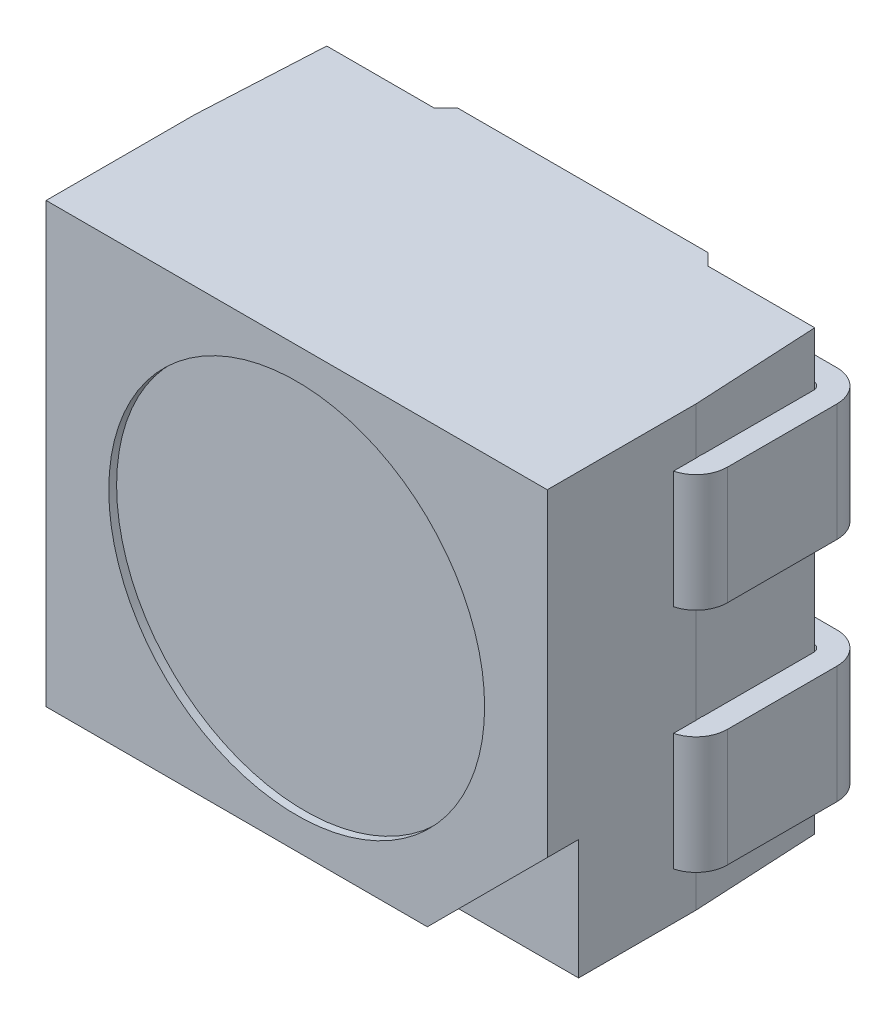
ISO-10303-21;
HEADER;
FILE_DESCRIPTION(('STEP AP214'),'2;1');
FILE_NAME('part.step','',(''),(''),'','','');
FILE_SCHEMA(('AUTOMOTIVE_DESIGN { 1 0 10303 214 1 1 1 1 }'));
ENDSEC;
DATA;
#1=APPLICATION_CONTEXT('core data for automotive mechanical design processes');
#2=APPLICATION_PROTOCOL_DEFINITION('international standard','automotive_design',2000,#1);
#3=PRODUCT_CONTEXT('',#1,'mechanical');
#4=PRODUCT('Part','Part','',(#3));
#5=PRODUCT_RELATED_PRODUCT_CATEGORY('part','',(#4));
#6=PRODUCT_DEFINITION_FORMATION('','',#4);
#7=PRODUCT_DEFINITION_CONTEXT('part definition',#1,'design');
#8=PRODUCT_DEFINITION('design','',#6,#7);
#9=PRODUCT_DEFINITION_SHAPE('','',#8);
#10=(LENGTH_UNIT() NAMED_UNIT(*) SI_UNIT(.MILLI.,.METRE.));
#11=(NAMED_UNIT(*) PLANE_ANGLE_UNIT() SI_UNIT($,.RADIAN.));
#12=(NAMED_UNIT(*) SI_UNIT($,.STERADIAN.) SOLID_ANGLE_UNIT());
#13=UNCERTAINTY_MEASURE_WITH_UNIT(LENGTH_MEASURE(1.E-05),#10,'distance_accuracy_value','');
#14=(GEOMETRIC_REPRESENTATION_CONTEXT(3) GLOBAL_UNCERTAINTY_ASSIGNED_CONTEXT((#13)) GLOBAL_UNIT_ASSIGNED_CONTEXT((#10,
#11,#12)) REPRESENTATION_CONTEXT('',''));
#15=CARTESIAN_POINT('',(0.,0.,0.));
#16=DIRECTION('',(0.,0.,1.));
#17=DIRECTION('',(1.,0.,0.));
#18=AXIS2_PLACEMENT_3D('',#15,#16,#17);
#19=CARTESIAN_POINT('',(0.,0.,1.85));
#20=DIRECTION('',(0.,0.,1.));
#21=DIRECTION('',(1.,0.,0.));
#22=AXIS2_PLACEMENT_3D('',#19,#20,#21);
#23=PLANE('',#22);
#24=CARTESIAN_POINT('',(0.,0.,1.85));
#25=DIRECTION('',(0.,0.,1.));
#26=DIRECTION('',(1.,0.,0.));
#27=AXIS2_PLACEMENT_3D('',#24,#25,#26);
#28=CIRCLE('',#27,1.2);
#29=CARTESIAN_POINT('',(1.2,0.,1.85));
#30=VERTEX_POINT('',#29);
#31=EDGE_CURVE('E1149',#30,#30,#28,.T.);
#32=ORIENTED_EDGE('',*,*,#31,.T.);
#33=EDGE_LOOP('',(#32));
#34=FACE_BOUND('',#33,.T.);
#35=ADVANCED_FACE('F17',(#34),#23,.T.);
#36=CARTESIAN_POINT('',(-0.95,-1.1,0.));
#37=DIRECTION('',(0.,0.,-1.));
#38=DIRECTION('',(0.,-1.,0.));
#39=AXIS2_PLACEMENT_3D('',#36,#37,#38);
#40=PLANE('',#39);
#41=DIRECTION('',(-1.,0.,0.));
#42=VECTOR('',#41,1.);
#43=CARTESIAN_POINT('',(0.,1.1,0.));
#44=LINE('',#43,#42);
#45=CARTESIAN_POINT('',(-0.95,1.1,0.));
#46=VERTEX_POINT('',#45);
#47=CARTESIAN_POINT('',(-1.55,1.1,0.));
#48=VERTEX_POINT('',#47);
#49=EDGE_CURVE('E481',#46,#48,#44,.T.);
#50=ORIENTED_EDGE('',*,*,#49,.F.);
#51=DIRECTION('',(0.,-1.,0.));
#52=VECTOR('',#51,1.);
#53=CARTESIAN_POINT('',(-0.95,-1.1,0.));
#54=LINE('',#53,#52);
#55=CARTESIAN_POINT('',(-0.95,0.35,0.));
#56=VERTEX_POINT('',#55);
#57=EDGE_CURVE('E1058',#46,#56,#54,.T.);
#58=ORIENTED_EDGE('',*,*,#57,.T.);
#59=DIRECTION('',(-1.,0.,0.));
#60=VECTOR('',#59,1.);
#61=CARTESIAN_POINT('',(3.395325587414,0.35,0.));
#62=LINE('',#61,#60);
#63=CARTESIAN_POINT('',(-1.55,0.35,0.));
#64=VERTEX_POINT('',#63);
#65=EDGE_CURVE('E484',#56,#64,#62,.T.);
#66=ORIENTED_EDGE('',*,*,#65,.T.);
#67=DIRECTION('',(0.,-1.,0.));
#68=VECTOR('',#67,1.);
#69=CARTESIAN_POINT('',(-1.55,-1.1,0.));
#70=LINE('',#69,#68);
#71=EDGE_CURVE('E11',#48,#64,#70,.T.);
#72=ORIENTED_EDGE('',*,*,#71,.F.);
#73=EDGE_LOOP('',(#50,#58,#66,#72));
#74=FACE_BOUND('',#73,.T.);
#75=ADVANCED_FACE('F479',(#74),#40,.T.);
#76=CARTESIAN_POINT('',(-1.55,-1.1,0.2));
#77=DIRECTION('',(0.,1.,0.));
#78=DIRECTION('',(0.707106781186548,0.,0.707106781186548));
#79=AXIS2_PLACEMENT_3D('',#76,#77,#78);
#80=CYLINDRICAL_SURFACE('',#79,0.2);
#81=CARTESIAN_POINT('',(-1.55,1.1,0.2));
#82=DIRECTION('',(0.,1.,0.));
#83=DIRECTION('',(0.,0.,1.));
#84=AXIS2_PLACEMENT_3D('',#81,#82,#83);
#85=CIRCLE('',#84,0.2);
#86=CARTESIAN_POINT('',(-1.75,1.1,0.2));
#87=VERTEX_POINT('',#86);
#88=EDGE_CURVE('E489',#48,#87,#85,.T.);
#89=ORIENTED_EDGE('',*,*,#88,.F.);
#90=ORIENTED_EDGE('',*,*,#71,.T.);
#91=CARTESIAN_POINT('',(-1.55,0.35,0.2));
#92=DIRECTION('',(0.,1.,0.));
#93=DIRECTION('',(0.,0.,1.));
#94=AXIS2_PLACEMENT_3D('',#91,#92,#93);
#95=CIRCLE('',#94,0.2);
#96=CARTESIAN_POINT('',(-1.75,0.35,0.2));
#97=VERTEX_POINT('',#96);
#98=EDGE_CURVE('E1049',#64,#97,#95,.T.);
#99=ORIENTED_EDGE('',*,*,#98,.T.);
#100=DIRECTION('',(0.,-1.,0.));
#101=VECTOR('',#100,1.);
#102=CARTESIAN_POINT('',(-1.75,-1.1,0.2));
#103=LINE('',#102,#101);
#104=EDGE_CURVE('E27',#87,#97,#103,.T.);
#105=ORIENTED_EDGE('',*,*,#104,.F.);
#106=EDGE_LOOP('',(#89,#90,#99,#105));
#107=FACE_BOUND('',#106,.T.);
#108=ADVANCED_FACE('F490',(#107),#80,.T.);
#109=CARTESIAN_POINT('',(-1.75,-1.1,0.2));
#110=DIRECTION('',(-1.,0.,0.));
#111=DIRECTION('',(0.,0.,1.));
#112=AXIS2_PLACEMENT_3D('',#109,#110,#111);
#113=PLANE('',#112);
#114=DIRECTION('',(0.,0.,1.));
#115=VECTOR('',#114,1.);
#116=CARTESIAN_POINT('',(-1.75,1.1,0.));
#117=LINE('',#116,#115);
#118=CARTESIAN_POINT('',(-1.75,1.1,0.9));
#119=VERTEX_POINT('',#118);
#120=EDGE_CURVE('E494',#87,#119,#117,.T.);
#121=ORIENTED_EDGE('',*,*,#120,.F.);
#122=ORIENTED_EDGE('',*,*,#104,.T.);
#123=DIRECTION('',(0.,0.,1.));
#124=VECTOR('',#123,1.);
#125=CARTESIAN_POINT('',(-1.75,0.35,0.));
#126=LINE('',#125,#124);
#127=CARTESIAN_POINT('',(-1.75,0.35,0.9));
#128=VERTEX_POINT('',#127);
#129=EDGE_CURVE('E1046',#97,#128,#126,.T.);
#130=ORIENTED_EDGE('',*,*,#129,.T.);
#131=DIRECTION('',(0.,-1.,0.));
#132=VECTOR('',#131,1.);
#133=CARTESIAN_POINT('',(-1.75,-1.1,0.9));
#134=LINE('',#133,#132);
#135=EDGE_CURVE('E41',#119,#128,#134,.T.);
#136=ORIENTED_EDGE('',*,*,#135,.F.);
#137=EDGE_LOOP('',(#121,#122,#130,#136));
#138=FACE_BOUND('',#137,.T.);
#139=ADVANCED_FACE('F2936',(#138),#113,.T.);
#140=CARTESIAN_POINT('',(-1.55,-1.1,0.9));
#141=DIRECTION('',(0.,1.,0.));
#142=DIRECTION('',(0.790569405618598,0.,-0.612372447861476));
#143=AXIS2_PLACEMENT_3D('',#140,#141,#142);
#144=CYLINDRICAL_SURFACE('',#143,0.2);
#145=ORIENTED_EDGE('',*,*,#135,.T.);
#146=CARTESIAN_POINT('',(-1.55,0.35,0.9));
#147=DIRECTION('',(0.,1.,0.));
#148=DIRECTION('',(0.,0.,1.));
#149=AXIS2_PLACEMENT_3D('',#146,#147,#148);
#150=CIRCLE('',#149,0.2);
#151=CARTESIAN_POINT('',(-1.59999999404,0.35,1.093649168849));
#152=VERTEX_POINT('',#151);
#153=EDGE_CURVE('E1043',#128,#152,#150,.T.);
#154=ORIENTED_EDGE('',*,*,#153,.T.);
#155=DIRECTION('',(0.,-1.,0.));
#156=VECTOR('',#155,1.);
#157=CARTESIAN_POINT('',(-1.59999999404,-1.4,1.093649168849));
#158=LINE('',#157,#156);
#159=CARTESIAN_POINT('',(-1.59999999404,1.1,1.093649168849));
#160=VERTEX_POINT('',#159);
#161=EDGE_CURVE('E855',#160,#152,#158,.T.);
#162=ORIENTED_EDGE('',*,*,#161,.F.);
#163=CARTESIAN_POINT('',(-1.55,1.1,0.9));
#164=DIRECTION('',(0.,1.,0.));
#165=DIRECTION('',(0.,0.,1.));
#166=AXIS2_PLACEMENT_3D('',#163,#164,#165);
#167=CIRCLE('',#166,0.2);
#168=EDGE_CURVE('E515',#119,#160,#167,.T.);
#169=ORIENTED_EDGE('',*,*,#168,.F.);
#170=EDGE_LOOP('',(#145,#154,#162,#169));
#171=FACE_BOUND('',#170,.T.);
#172=ADVANCED_FACE('F2931',(#171),#144,.T.);
#173=CARTESIAN_POINT('',(-1.55,-1.1,0.2));
#174=DIRECTION('',(0.,-1.,0.));
#175=DIRECTION('',(0.761833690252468,0.,0.647772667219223));
#176=AXIS2_PLACEMENT_3D('',#173,#174,#175);
#177=CYLINDRICAL_SURFACE('',#176,0.04999999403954);
#178=CARTESIAN_POINT('',(-1.55,1.1,0.2));
#179=DIRECTION('',(0.,-1.,0.));
#180=DIRECTION('',(0.,0.,-1.));
#181=AXIS2_PLACEMENT_3D('',#178,#179,#180);
#182=CIRCLE('',#181,0.04999999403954);
#183=CARTESIAN_POINT('',(-1.59999999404,1.1,0.2));
#184=VERTEX_POINT('',#183);
#185=CARTESIAN_POINT('',(-1.558091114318,1.1,0.150330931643));
#186=VERTEX_POINT('',#185);
#187=EDGE_CURVE('E502',#184,#186,#182,.T.);
#188=ORIENTED_EDGE('',*,*,#187,.F.);
#189=DIRECTION('',(0.,1.,0.));
#190=VECTOR('',#189,1.);
#191=CARTESIAN_POINT('',(-1.59999999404,-1.1,0.2));
#192=LINE('',#191,#190);
#193=CARTESIAN_POINT('',(-1.59999999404,0.35,0.2));
#194=VERTEX_POINT('',#193);
#195=EDGE_CURVE('E525',#194,#184,#192,.T.);
#196=ORIENTED_EDGE('',*,*,#195,.F.);
#197=CARTESIAN_POINT('',(-1.55,0.35,0.2));
#198=DIRECTION('',(0.,-1.,0.));
#199=DIRECTION('',(0.,0.,-1.));
#200=AXIS2_PLACEMENT_3D('',#197,#198,#199);
#201=CIRCLE('',#200,0.04999999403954);
#202=CARTESIAN_POINT('',(-1.558091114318,0.35,0.150330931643));
#203=VERTEX_POINT('',#202);
#204=EDGE_CURVE('E554',#194,#203,#201,.T.);
#205=ORIENTED_EDGE('',*,*,#204,.T.);
#206=DIRECTION('',(0.,-1.,0.));
#207=VECTOR('',#206,1.);
#208=CARTESIAN_POINT('',(-1.558108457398,-1.4,0.150661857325));
#209=LINE('',#208,#207);
#210=EDGE_CURVE('E534',#186,#203,#209,.T.);
#211=ORIENTED_EDGE('',*,*,#210,.F.);
#212=EDGE_LOOP('',(#188,#196,#205,#211));
#213=FACE_BOUND('',#212,.T.);
#214=ADVANCED_FACE('F1075',(#213),#177,.F.);
#215=CARTESIAN_POINT('',(-1.59999999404,-1.1,0.9));
#216=DIRECTION('',(1.,0.,0.));
#217=DIRECTION('',(0.,1.,0.));
#218=AXIS2_PLACEMENT_3D('',#215,#216,#217);
#219=PLANE('',#218);
#220=DIRECTION('',(0.,0.,-1.));
#221=VECTOR('',#220,1.);
#222=CARTESIAN_POINT('',(-1.59999999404,1.1,0.));
#223=LINE('',#222,#221);
#224=CARTESIAN_POINT('',(-1.59999999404,1.1,0.9));
#225=VERTEX_POINT('',#224);
#226=EDGE_CURVE('E508',#225,#184,#223,.T.);
#227=ORIENTED_EDGE('',*,*,#226,.F.);
#228=DIRECTION('',(0.,-1.,0.));
#229=VECTOR('',#228,1.);
#230=CARTESIAN_POINT('',(-1.59999999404,-1.1,0.9));
#231=LINE('',#230,#229);
#232=CARTESIAN_POINT('',(-1.59999999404,0.35,0.9));
#233=VERTEX_POINT('',#232);
#234=EDGE_CURVE('E522',#225,#233,#231,.T.);
#235=ORIENTED_EDGE('',*,*,#234,.T.);
#236=DIRECTION('',(0.,0.,-1.));
#237=VECTOR('',#236,1.);
#238=CARTESIAN_POINT('',(-1.59999999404,0.35,0.));
#239=LINE('',#238,#237);
#240=EDGE_CURVE('E557',#233,#194,#239,.T.);
#241=ORIENTED_EDGE('',*,*,#240,.T.);
#242=ORIENTED_EDGE('',*,*,#195,.T.);
#243=EDGE_LOOP('',(#227,#235,#241,#242));
#244=FACE_BOUND('',#243,.T.);
#245=ADVANCED_FACE('F1071',(#244),#219,.T.);
#246=CARTESIAN_POINT('',(-1.55,-1.1,0.9));
#247=DIRECTION('',(0.,-1.,0.));
#248=DIRECTION('',(0.990433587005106,0.,-0.13799025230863));
#249=AXIS2_PLACEMENT_3D('',#246,#247,#248);
#250=CYLINDRICAL_SURFACE('',#249,0.04999999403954);
#251=CARTESIAN_POINT('',(-1.55,0.35,0.9));
#252=DIRECTION('',(0.,-1.,0.));
#253=DIRECTION('',(0.,0.,-1.));
#254=AXIS2_PLACEMENT_3D('',#251,#252,#253);
#255=CIRCLE('',#254,0.04999999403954);
#256=CARTESIAN_POINT('',(-1.598095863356,0.35,0.913667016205));
#257=VERTEX_POINT('',#256);
#258=EDGE_CURVE('E1039',#257,#233,#255,.T.);
#259=ORIENTED_EDGE('',*,*,#258,.T.);
#260=ORIENTED_EDGE('',*,*,#234,.F.);
#261=CARTESIAN_POINT('',(-1.55,1.1,0.9));
#262=DIRECTION('',(0.,-1.,0.));
#263=DIRECTION('',(0.,0.,1.));
#264=AXIS2_PLACEMENT_3D('',#261,#262,#263);
#265=CIRCLE('',#264,0.04999999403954);
#266=CARTESIAN_POINT('',(-1.598095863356,1.1,0.913667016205));
#267=VERTEX_POINT('',#266);
#268=EDGE_CURVE('E518',#267,#225,#265,.T.);
#269=ORIENTED_EDGE('',*,*,#268,.F.);
#270=DIRECTION('',(0.,1.,0.));
#271=VECTOR('',#270,1.);
#272=CARTESIAN_POINT('',(-1.598095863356,-1.4,0.913667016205));
#273=LINE('',#272,#271);
#274=EDGE_CURVE('E776',#257,#267,#273,.T.);
#275=ORIENTED_EDGE('',*,*,#274,.F.);
#276=EDGE_LOOP('',(#259,#260,#269,#275));
#277=FACE_BOUND('',#276,.T.);
#278=ADVANCED_FACE('F2806',(#277),#250,.F.);
#279=CARTESIAN_POINT('',(0.,1.1,0.));
#280=DIRECTION('',(0.,1.,0.));
#281=DIRECTION('',(1.,0.,0.));
#282=AXIS2_PLACEMENT_3D('',#279,#280,#281);
#283=PLANE('',#282);
#284=ORIENTED_EDGE('',*,*,#226,.T.);
#285=ORIENTED_EDGE('',*,*,#187,.T.);
#286=DIRECTION('',(1.,0.,0.));
#287=VECTOR('',#286,1.);
#288=CARTESIAN_POINT('',(0.,1.1,0.15000000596));
#289=LINE('',#288,#287);
#290=CARTESIAN_POINT('',(-0.95,1.1,0.15000000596));
#291=VERTEX_POINT('',#290);
#292=EDGE_CURVE('E546',#186,#291,#289,.T.);
#293=ORIENTED_EDGE('',*,*,#292,.T.);
#294=DIRECTION('',(0.,0.,-1.));
#295=VECTOR('',#294,1.);
#296=CARTESIAN_POINT('',(-0.95,1.1,0.));
#297=LINE('',#296,#295);
#298=EDGE_CURVE('E499',#291,#46,#297,.T.);
#299=ORIENTED_EDGE('',*,*,#298,.T.);
#300=ORIENTED_EDGE('',*,*,#49,.T.);
#301=ORIENTED_EDGE('',*,*,#88,.T.);
#302=ORIENTED_EDGE('',*,*,#120,.T.);
#303=ORIENTED_EDGE('',*,*,#168,.T.);
#304=DIRECTION('',(0.,0.,-1.));
#305=VECTOR('',#304,1.);
#306=CARTESIAN_POINT('',(-1.59999999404,1.1,0.));
#307=LINE('',#306,#305);
#308=CARTESIAN_POINT('',(-1.59999999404,1.1,0.94999999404));
#309=VERTEX_POINT('',#308);
#310=EDGE_CURVE('E852',#160,#309,#307,.T.);
#311=ORIENTED_EDGE('',*,*,#310,.T.);
#312=DIRECTION('',(-0.0523359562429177,0.,0.998629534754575));
#313=VECTOR('',#312,1.);
#314=CARTESIAN_POINT('',(-1.558073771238,1.1,0.15000000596));
#315=LINE('',#314,#313);
#316=EDGE_CURVE('E772',#267,#309,#315,.T.);
#317=ORIENTED_EDGE('',*,*,#316,.F.);
#318=ORIENTED_EDGE('',*,*,#268,.T.);
#319=EDGE_LOOP('',(#284,#285,#293,#299,#300,#301,#302,#303,#311,#317,#318));
#320=FACE_BOUND('',#319,.T.);
#321=ADVANCED_FACE('F497',(#320),#283,.T.);
#322=CARTESIAN_POINT('',(-0.95,-1.1,0.15000000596));
#323=DIRECTION('',(1.,0.,0.));
#324=DIRECTION('',(0.,1.,0.));
#325=AXIS2_PLACEMENT_3D('',#322,#323,#324);
#326=PLANE('',#325);
#327=ORIENTED_EDGE('',*,*,#57,.F.);
#328=ORIENTED_EDGE('',*,*,#298,.F.);
#329=DIRECTION('',(0.,-1.,0.));
#330=VECTOR('',#329,1.);
#331=CARTESIAN_POINT('',(-0.95,-1.1,0.15000000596));
#332=LINE('',#331,#330);
#333=CARTESIAN_POINT('',(-0.95,0.35,0.15000000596));
#334=VERTEX_POINT('',#333);
#335=EDGE_CURVE('E551',#291,#334,#332,.T.);
#336=ORIENTED_EDGE('',*,*,#335,.T.);
#337=DIRECTION('',(0.,0.,-1.));
#338=VECTOR('',#337,1.);
#339=CARTESIAN_POINT('',(-0.95,0.35,0.));
#340=LINE('',#339,#338);
#341=EDGE_CURVE('E1054',#334,#56,#340,.T.);
#342=ORIENTED_EDGE('',*,*,#341,.T.);
#343=EDGE_LOOP('',(#327,#328,#336,#342));
#344=FACE_BOUND('',#343,.T.);
#345=ADVANCED_FACE('F2764',(#344),#326,.T.);
#346=CARTESIAN_POINT('',(3.395325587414,0.35,0.));
#347=DIRECTION('',(0.,1.,0.));
#348=DIRECTION('',(1.,0.,0.));
#349=AXIS2_PLACEMENT_3D('',#346,#347,#348);
#350=PLANE('',#349);
#351=ORIENTED_EDGE('',*,*,#204,.F.);
#352=ORIENTED_EDGE('',*,*,#240,.F.);
#353=ORIENTED_EDGE('',*,*,#258,.F.);
#354=DIRECTION('',(0.0523359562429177,0.,-0.998629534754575));
#355=VECTOR('',#354,1.);
#356=CARTESIAN_POINT('',(-1.558073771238,0.35,0.15000000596));
#357=LINE('',#356,#355);
#358=CARTESIAN_POINT('',(-1.59999999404,0.35,0.94999999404));
#359=VERTEX_POINT('',#358);
#360=EDGE_CURVE('E768',#359,#257,#357,.T.);
#361=ORIENTED_EDGE('',*,*,#360,.F.);
#362=DIRECTION('',(0.,0.,-1.));
#363=VECTOR('',#362,1.);
#364=CARTESIAN_POINT('',(-1.59999999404,0.35,0.));
#365=LINE('',#364,#363);
#366=EDGE_CURVE('E860',#152,#359,#365,.T.);
#367=ORIENTED_EDGE('',*,*,#366,.F.);
#368=ORIENTED_EDGE('',*,*,#153,.F.);
#369=ORIENTED_EDGE('',*,*,#129,.F.);
#370=ORIENTED_EDGE('',*,*,#98,.F.);
#371=ORIENTED_EDGE('',*,*,#65,.F.);
#372=ORIENTED_EDGE('',*,*,#341,.F.);
#373=DIRECTION('',(1.,0.,0.));
#374=VECTOR('',#373,1.);
#375=CARTESIAN_POINT('',(-0.87500000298,0.35,0.15000000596));
#376=LINE('',#375,#374);
#377=EDGE_CURVE('E561',#203,#334,#376,.T.);
#378=ORIENTED_EDGE('',*,*,#377,.F.);
#379=EDGE_LOOP('',(#351,#352,#353,#361,#367,#368,#369,#370,#371,#372,#378));
#380=FACE_BOUND('',#379,.T.);
#381=ADVANCED_FACE('F2769',(#380),#350,.F.);
#382=CARTESIAN_POINT('',(0.,0.,1.7));
#383=DIRECTION('',(0.,0.,1.));
#384=DIRECTION('',(1.,0.,0.));
#385=AXIS2_PLACEMENT_3D('',#382,#383,#384);
#386=PLANE('',#385);
#387=DIRECTION('',(0.,-1.,0.));
#388=VECTOR('',#387,1.);
#389=CARTESIAN_POINT('',(1.59999999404,-1.4,1.7));
#390=LINE('',#389,#388);
#391=CARTESIAN_POINT('',(1.59999999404,-0.634097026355,1.7));
#392=VERTEX_POINT('',#391);
#393=CARTESIAN_POINT('',(1.59999999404,-1.4,1.7));
#394=VERTEX_POINT('',#393);
#395=EDGE_CURVE('E793',#392,#394,#390,.T.);
#396=ORIENTED_EDGE('',*,*,#395,.F.);
#397=DIRECTION('',(-0.707106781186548,-0.707106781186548,0.));
#398=VECTOR('',#397,1.);
#399=CARTESIAN_POINT('',(2.081055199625,-0.15304182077,1.7));
#400=LINE('',#399,#398);
#401=CARTESIAN_POINT('',(0.834097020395,-1.4,1.7));
#402=VERTEX_POINT('',#401);
#403=EDGE_CURVE('E811',#392,#402,#400,.T.);
#404=ORIENTED_EDGE('',*,*,#403,.T.);
#405=DIRECTION('',(1.,0.,0.));
#406=VECTOR('',#405,1.);
#407=CARTESIAN_POINT('',(0.,-1.4,1.7));
#408=LINE('',#407,#406);
#409=EDGE_CURVE('E901',#402,#394,#408,.T.);
#410=ORIENTED_EDGE('',*,*,#409,.T.);
#411=EDGE_LOOP('',(#396,#404,#410));
#412=FACE_BOUND('',#411,.T.);
#413=ADVANCED_FACE('F1270',(#412),#386,.T.);
#414=CARTESIAN_POINT('',(1.75,-1.1,0.9));
#415=DIRECTION('',(1.,0.,0.));
#416=DIRECTION('',(0.,0.,1.));
#417=AXIS2_PLACEMENT_3D('',#414,#415,#416);
#418=PLANE('',#417);
#419=DIRECTION('',(0.,0.,-1.));
#420=VECTOR('',#419,1.);
#421=CARTESIAN_POINT('',(1.75,1.1,0.));
#422=LINE('',#421,#420);
#423=CARTESIAN_POINT('',(1.75,1.1,0.9));
#424=VERTEX_POINT('',#423);
#425=CARTESIAN_POINT('',(1.75,1.1,0.2));
#426=VERTEX_POINT('',#425);
#427=EDGE_CURVE('E1008',#424,#426,#422,.T.);
#428=ORIENTED_EDGE('',*,*,#427,.F.);
#429=DIRECTION('',(0.,-1.,0.));
#430=VECTOR('',#429,1.);
#431=CARTESIAN_POINT('',(1.75,-1.1,0.9));
#432=LINE('',#431,#430);
#433=CARTESIAN_POINT('',(1.75,0.35,0.9));
#434=VERTEX_POINT('',#433);
#435=EDGE_CURVE('E998',#424,#434,#432,.T.);
#436=ORIENTED_EDGE('',*,*,#435,.T.);
#437=DIRECTION('',(0.,0.,-1.));
#438=VECTOR('',#437,1.);
#439=CARTESIAN_POINT('',(1.75,0.35,0.));
#440=LINE('',#439,#438);
#441=CARTESIAN_POINT('',(1.75,0.35,0.2));
#442=VERTEX_POINT('',#441);
#443=EDGE_CURVE('E887',#434,#442,#440,.T.);
#444=ORIENTED_EDGE('',*,*,#443,.T.);
#445=DIRECTION('',(0.,-1.,0.));
#446=VECTOR('',#445,1.);
#447=CARTESIAN_POINT('',(1.75,-1.1,0.2));
#448=LINE('',#447,#446);
#449=EDGE_CURVE('E558',#426,#442,#448,.T.);
#450=ORIENTED_EDGE('',*,*,#449,.F.);
#451=EDGE_LOOP('',(#428,#436,#444,#450));
#452=FACE_BOUND('',#451,.T.);
#453=ADVANCED_FACE('F2995',(#452),#418,.T.);
#454=CARTESIAN_POINT('',(1.55,-1.1,0.2));
#455=DIRECTION('',(0.,1.,0.));
#456=DIRECTION('',(-0.707106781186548,0.,0.707106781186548));
#457=AXIS2_PLACEMENT_3D('',#454,#455,#456);
#458=CYLINDRICAL_SURFACE('',#457,0.2);
#459=CARTESIAN_POINT('',(1.55,1.1,0.2));
#460=DIRECTION('',(0.,1.,0.));
#461=DIRECTION('',(0.,0.,1.));
#462=AXIS2_PLACEMENT_3D('',#459,#460,#461);
#463=CIRCLE('',#462,0.2);
#464=CARTESIAN_POINT('',(1.55,1.1,0.));
#465=VERTEX_POINT('',#464);
#466=EDGE_CURVE('E1012',#426,#465,#463,.T.);
#467=ORIENTED_EDGE('',*,*,#466,.F.);
#468=ORIENTED_EDGE('',*,*,#449,.T.);
#469=CARTESIAN_POINT('',(1.55,0.35,0.2));
#470=DIRECTION('',(0.,1.,0.));
#471=DIRECTION('',(0.,0.,1.));
#472=AXIS2_PLACEMENT_3D('',#469,#470,#471);
#473=CIRCLE('',#472,0.2);
#474=CARTESIAN_POINT('',(1.55,0.35,0.));
#475=VERTEX_POINT('',#474);
#476=EDGE_CURVE('E892',#442,#475,#473,.T.);
#477=ORIENTED_EDGE('',*,*,#476,.T.);
#478=DIRECTION('',(0.,-1.,0.));
#479=VECTOR('',#478,1.);
#480=CARTESIAN_POINT('',(1.55,-1.1,0.));
#481=LINE('',#480,#479);
#482=EDGE_CURVE('E1031',#465,#475,#481,.T.);
#483=ORIENTED_EDGE('',*,*,#482,.F.);
#484=EDGE_LOOP('',(#467,#468,#477,#483));
#485=FACE_BOUND('',#484,.T.);
#486=ADVANCED_FACE('F2984',(#485),#458,.T.);
#487=CARTESIAN_POINT('',(1.55,-1.1,0.));
#488=DIRECTION('',(0.,0.,-1.));
#489=DIRECTION('',(0.,-1.,0.));
#490=AXIS2_PLACEMENT_3D('',#487,#488,#489);
#491=PLANE('',#490);
#492=DIRECTION('',(-1.,0.,0.));
#493=VECTOR('',#492,1.);
#494=CARTESIAN_POINT('',(0.,1.1,0.));
#495=LINE('',#494,#493);
#496=CARTESIAN_POINT('',(0.95,1.1,0.));
#497=VERTEX_POINT('',#496);
#498=EDGE_CURVE('E1016',#465,#497,#495,.T.);
#499=ORIENTED_EDGE('',*,*,#498,.F.);
#500=ORIENTED_EDGE('',*,*,#482,.T.);
#501=DIRECTION('',(-1.,0.,0.));
#502=VECTOR('',#501,1.);
#503=CARTESIAN_POINT('',(3.395325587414,0.35,0.));
#504=LINE('',#503,#502);
#505=CARTESIAN_POINT('',(0.95,0.35,0.));
#506=VERTEX_POINT('',#505);
#507=EDGE_CURVE('E988',#475,#506,#504,.T.);
#508=ORIENTED_EDGE('',*,*,#507,.T.);
#509=DIRECTION('',(0.,-1.,0.));
#510=VECTOR('',#509,1.);
#511=CARTESIAN_POINT('',(0.95,-1.1,0.));
#512=LINE('',#511,#510);
#513=EDGE_CURVE('E1028',#497,#506,#512,.T.);
#514=ORIENTED_EDGE('',*,*,#513,.F.);
#515=EDGE_LOOP('',(#499,#500,#508,#514));
#516=FACE_BOUND('',#515,.T.);
#517=ADVANCED_FACE('F2870',(#516),#491,.T.);
#518=CARTESIAN_POINT('',(0.95,-1.1,0.));
#519=DIRECTION('',(-1.,0.,0.));
#520=DIRECTION('',(0.,0.,1.));
#521=AXIS2_PLACEMENT_3D('',#518,#519,#520);
#522=PLANE('',#521);
#523=ORIENTED_EDGE('',*,*,#513,.T.);
#524=DIRECTION('',(0.,0.,1.));
#525=VECTOR('',#524,1.);
#526=CARTESIAN_POINT('',(0.95,0.35,0.));
#527=LINE('',#526,#525);
#528=CARTESIAN_POINT('',(0.95,0.35,0.15000000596));
#529=VERTEX_POINT('',#528);
#530=EDGE_CURVE('E608',#506,#529,#527,.T.);
#531=ORIENTED_EDGE('',*,*,#530,.T.);
#532=DIRECTION('',(0.,-1.,0.));
#533=VECTOR('',#532,1.);
#534=CARTESIAN_POINT('',(0.95,-1.4,0.15000000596));
#535=LINE('',#534,#533);
#536=CARTESIAN_POINT('',(0.95,1.1,0.15000000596));
#537=VERTEX_POINT('',#536);
#538=EDGE_CURVE('E586',#537,#529,#535,.T.);
#539=ORIENTED_EDGE('',*,*,#538,.F.);
#540=DIRECTION('',(0.,0.,1.));
#541=VECTOR('',#540,1.);
#542=CARTESIAN_POINT('',(0.95,1.1,0.));
#543=LINE('',#542,#541);
#544=EDGE_CURVE('E579',#497,#537,#543,.T.);
#545=ORIENTED_EDGE('',*,*,#544,.F.);
#546=EDGE_LOOP('',(#523,#531,#539,#545));
#547=FACE_BOUND('',#546,.T.);
#548=ADVANCED_FACE('F2838',(#547),#522,.T.);
#549=CARTESIAN_POINT('',(1.55,-1.1,0.2));
#550=DIRECTION('',(0.,-1.,0.));
#551=DIRECTION('',(-0.761833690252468,0.,0.647772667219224));
#552=AXIS2_PLACEMENT_3D('',#549,#550,#551);
#553=CYLINDRICAL_SURFACE('',#552,0.04999999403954);
#554=CARTESIAN_POINT('',(1.55,0.35,0.2));
#555=DIRECTION('',(0.,-1.,0.));
#556=DIRECTION('',(0.,0.,-1.));
#557=AXIS2_PLACEMENT_3D('',#554,#555,#556);
#558=CIRCLE('',#557,0.04999999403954);
#559=CARTESIAN_POINT('',(1.558091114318,0.35,0.150330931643));
#560=VERTEX_POINT('',#559);
#561=CARTESIAN_POINT('',(1.59999999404,0.35,0.2));
#562=VERTEX_POINT('',#561);
#563=EDGE_CURVE('E604',#560,#562,#558,.T.);
#564=ORIENTED_EDGE('',*,*,#563,.T.);
#565=DIRECTION('',(0.,-1.,0.));
#566=VECTOR('',#565,1.);
#567=CARTESIAN_POINT('',(1.59999999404,-1.1,0.2));
#568=LINE('',#567,#566);
#569=CARTESIAN_POINT('',(1.59999999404,1.1,0.2));
#570=VERTEX_POINT('',#569);
#571=EDGE_CURVE('E1022',#570,#562,#568,.T.);
#572=ORIENTED_EDGE('',*,*,#571,.F.);
#573=CARTESIAN_POINT('',(1.55,1.1,0.2));
#574=DIRECTION('',(0.,-1.,0.));
#575=DIRECTION('',(0.,0.,-1.));
#576=AXIS2_PLACEMENT_3D('',#573,#574,#575);
#577=CIRCLE('',#576,0.04999999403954);
#578=CARTESIAN_POINT('',(1.558091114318,1.1,0.150330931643));
#579=VERTEX_POINT('',#578);
#580=EDGE_CURVE('E574',#579,#570,#577,.T.);
#581=ORIENTED_EDGE('',*,*,#580,.F.);
#582=DIRECTION('',(0.,1.,0.));
#583=VECTOR('',#582,1.);
#584=CARTESIAN_POINT('',(1.558108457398,-1.4,0.150661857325));
#585=LINE('',#584,#583);
#586=EDGE_CURVE('E595',#560,#579,#585,.T.);
#587=ORIENTED_EDGE('',*,*,#586,.F.);
#588=EDGE_LOOP('',(#564,#572,#581,#587));
#589=FACE_BOUND('',#588,.T.);
#590=ADVANCED_FACE('F2832',(#589),#553,.F.);
#591=CARTESIAN_POINT('',(1.55,-1.1,0.9));
#592=DIRECTION('',(0.,-1.,0.));
#593=DIRECTION('',(-0.990433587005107,0.,-0.137990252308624));
#594=AXIS2_PLACEMENT_3D('',#591,#592,#593);
#595=CYLINDRICAL_SURFACE('',#594,0.04999999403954);
#596=CARTESIAN_POINT('',(1.55,1.1,0.9));
#597=DIRECTION('',(0.,-1.,0.));
#598=DIRECTION('',(0.,0.,1.));
#599=AXIS2_PLACEMENT_3D('',#596,#597,#598);
#600=CIRCLE('',#599,0.04999999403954);
#601=CARTESIAN_POINT('',(1.59999999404,1.1,0.9));
#602=VERTEX_POINT('',#601);
#603=CARTESIAN_POINT('',(1.598095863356,1.1,0.913667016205));
#604=VERTEX_POINT('',#603);
#605=EDGE_CURVE('E1005',#602,#604,#600,.T.);
#606=ORIENTED_EDGE('',*,*,#605,.F.);
#607=DIRECTION('',(0.,1.,0.));
#608=VECTOR('',#607,1.);
#609=CARTESIAN_POINT('',(1.59999999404,-1.1,0.9));
#610=LINE('',#609,#608);
#611=CARTESIAN_POINT('',(1.59999999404,0.35,0.9));
#612=VERTEX_POINT('',#611);
#613=EDGE_CURVE('E1025',#612,#602,#610,.T.);
#614=ORIENTED_EDGE('',*,*,#613,.F.);
#615=CARTESIAN_POINT('',(1.55,0.35,0.9));
#616=DIRECTION('',(0.,-1.,0.));
#617=DIRECTION('',(0.,0.,-1.));
#618=AXIS2_PLACEMENT_3D('',#615,#616,#617);
#619=CIRCLE('',#618,0.04999999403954);
#620=CARTESIAN_POINT('',(1.598095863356,0.35,0.913667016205));
#621=VERTEX_POINT('',#620);
#622=EDGE_CURVE('E980',#612,#621,#619,.T.);
#623=ORIENTED_EDGE('',*,*,#622,.T.);
#624=DIRECTION('',(0.,-1.,0.));
#625=VECTOR('',#624,1.);
#626=CARTESIAN_POINT('',(1.598095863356,-1.4,0.913667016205));
#627=LINE('',#626,#625);
#628=EDGE_CURVE('E935',#604,#621,#627,.T.);
#629=ORIENTED_EDGE('',*,*,#628,.F.);
#630=EDGE_LOOP('',(#606,#614,#623,#629));
#631=FACE_BOUND('',#630,.T.);
#632=ADVANCED_FACE('F2837',(#631),#595,.F.);
#633=CARTESIAN_POINT('',(1.59999999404,-1.1,0.2));
#634=DIRECTION('',(-1.,0.,0.));
#635=DIRECTION('',(0.,0.,1.));
#636=AXIS2_PLACEMENT_3D('',#633,#634,#635);
#637=PLANE('',#636);
#638=DIRECTION('',(0.,0.,1.));
#639=VECTOR('',#638,1.);
#640=CARTESIAN_POINT('',(1.59999999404,1.1,0.));
#641=LINE('',#640,#639);
#642=EDGE_CURVE('E578',#570,#602,#641,.T.);
#643=ORIENTED_EDGE('',*,*,#642,.F.);
#644=ORIENTED_EDGE('',*,*,#571,.T.);
#645=DIRECTION('',(0.,0.,1.));
#646=VECTOR('',#645,1.);
#647=CARTESIAN_POINT('',(1.59999999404,0.35,0.));
#648=LINE('',#647,#646);
#649=EDGE_CURVE('E609',#562,#612,#648,.T.);
#650=ORIENTED_EDGE('',*,*,#649,.T.);
#651=ORIENTED_EDGE('',*,*,#613,.T.);
#652=EDGE_LOOP('',(#643,#644,#650,#651));
#653=FACE_BOUND('',#652,.T.);
#654=ADVANCED_FACE('F2850',(#653),#637,.T.);
#655=CARTESIAN_POINT('',(0.,1.1,0.));
#656=DIRECTION('',(0.,1.,0.));
#657=DIRECTION('',(1.,0.,0.));
#658=AXIS2_PLACEMENT_3D('',#655,#656,#657);
#659=PLANE('',#658);
#660=ORIENTED_EDGE('',*,*,#605,.T.);
#661=DIRECTION('',(-0.0523359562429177,0.,-0.998629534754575));
#662=VECTOR('',#661,1.);
#663=CARTESIAN_POINT('',(1.59999999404,1.1,0.94999999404));
#664=LINE('',#663,#662);
#665=CARTESIAN_POINT('',(1.59999999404,1.1,0.94999999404));
#666=VERTEX_POINT('',#665);
#667=EDGE_CURVE('E594',#666,#604,#664,.T.);
#668=ORIENTED_EDGE('',*,*,#667,.F.);
#669=DIRECTION('',(0.,0.,1.));
#670=VECTOR('',#669,1.);
#671=CARTESIAN_POINT('',(1.59999999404,1.1,0.));
#672=LINE('',#671,#670);
#673=CARTESIAN_POINT('',(1.59999999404,1.1,1.093649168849));
#674=VERTEX_POINT('',#673);
#675=EDGE_CURVE('E871',#666,#674,#672,.T.);
#676=ORIENTED_EDGE('',*,*,#675,.T.);
#677=CARTESIAN_POINT('',(1.55,1.1,0.9));
#678=DIRECTION('',(0.,1.,0.));
#679=DIRECTION('',(0.,0.,1.));
#680=AXIS2_PLACEMENT_3D('',#677,#678,#679);
#681=CIRCLE('',#680,0.2);
#682=EDGE_CURVE('E1001',#674,#424,#681,.T.);
#683=ORIENTED_EDGE('',*,*,#682,.T.);
#684=ORIENTED_EDGE('',*,*,#427,.T.);
#685=ORIENTED_EDGE('',*,*,#466,.T.);
#686=ORIENTED_EDGE('',*,*,#498,.T.);
#687=ORIENTED_EDGE('',*,*,#544,.T.);
#688=DIRECTION('',(-1.,0.,0.));
#689=VECTOR('',#688,1.);
#690=CARTESIAN_POINT('',(1.558073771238,1.1,0.15000000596));
#691=LINE('',#690,#689);
#692=EDGE_CURVE('E582',#579,#537,#691,.T.);
#693=ORIENTED_EDGE('',*,*,#692,.F.);
#694=ORIENTED_EDGE('',*,*,#580,.T.);
#695=ORIENTED_EDGE('',*,*,#642,.T.);
#696=EDGE_LOOP('',(#660,#668,#676,#683,#684,#685,#686,#687,#693,#694,#695));
#697=FACE_BOUND('',#696,.T.);
#698=ADVANCED_FACE('F2955',(#697),#659,.T.);
#699=CARTESIAN_POINT('',(1.55,-1.1,0.9));
#700=DIRECTION('',(0.,1.,0.));
#701=DIRECTION('',(-0.790569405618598,0.,-0.612372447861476));
#702=AXIS2_PLACEMENT_3D('',#699,#700,#701);
#703=CYLINDRICAL_SURFACE('',#702,0.2);
#704=ORIENTED_EDGE('',*,*,#435,.F.);
#705=ORIENTED_EDGE('',*,*,#682,.F.);
#706=DIRECTION('',(0.,1.,0.));
#707=VECTOR('',#706,1.);
#708=CARTESIAN_POINT('',(1.59999999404,-1.4,1.093649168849));
#709=LINE('',#708,#707);
#710=CARTESIAN_POINT('',(1.59999999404,0.35,1.093649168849));
#711=VERTEX_POINT('',#710);
#712=EDGE_CURVE('E867',#711,#674,#709,.T.);
#713=ORIENTED_EDGE('',*,*,#712,.F.);
#714=CARTESIAN_POINT('',(1.55,0.35,0.9));
#715=DIRECTION('',(0.,1.,0.));
#716=DIRECTION('',(0.,0.,1.));
#717=AXIS2_PLACEMENT_3D('',#714,#715,#716);
#718=CIRCLE('',#717,0.2);
#719=EDGE_CURVE('E891',#711,#434,#718,.T.);
#720=ORIENTED_EDGE('',*,*,#719,.T.);
#721=EDGE_LOOP('',(#704,#705,#713,#720));
#722=FACE_BOUND('',#721,.T.);
#723=ADVANCED_FACE('F2608',(#722),#703,.T.);
#724=CARTESIAN_POINT('',(3.395325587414,0.35,0.));
#725=DIRECTION('',(0.,1.,0.));
#726=DIRECTION('',(1.,0.,0.));
#727=AXIS2_PLACEMENT_3D('',#724,#725,#726);
#728=PLANE('',#727);
#729=DIRECTION('',(0.0523359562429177,0.,0.998629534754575));
#730=VECTOR('',#729,1.);
#731=CARTESIAN_POINT('',(1.59999999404,0.35,0.94999999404));
#732=LINE('',#731,#730);
#733=CARTESIAN_POINT('',(1.59999999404,0.35,0.94999999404));
#734=VERTEX_POINT('',#733);
#735=EDGE_CURVE('E939',#621,#734,#732,.T.);
#736=ORIENTED_EDGE('',*,*,#735,.F.);
#737=ORIENTED_EDGE('',*,*,#622,.F.);
#738=ORIENTED_EDGE('',*,*,#649,.F.);
#739=ORIENTED_EDGE('',*,*,#563,.F.);
#740=DIRECTION('',(1.,0.,0.));
#741=VECTOR('',#740,1.);
#742=CARTESIAN_POINT('',(1.558073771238,0.35,0.15000000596));
#743=LINE('',#742,#741);
#744=EDGE_CURVE('E612',#529,#560,#743,.T.);
#745=ORIENTED_EDGE('',*,*,#744,.F.);
#746=ORIENTED_EDGE('',*,*,#530,.F.);
#747=ORIENTED_EDGE('',*,*,#507,.F.);
#748=ORIENTED_EDGE('',*,*,#476,.F.);
#749=ORIENTED_EDGE('',*,*,#443,.F.);
#750=ORIENTED_EDGE('',*,*,#719,.F.);
#751=DIRECTION('',(0.,0.,1.));
#752=VECTOR('',#751,1.);
#753=CARTESIAN_POINT('',(1.59999999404,0.35,0.));
#754=LINE('',#753,#752);
#755=EDGE_CURVE('E872',#734,#711,#754,.T.);
#756=ORIENTED_EDGE('',*,*,#755,.F.);
#757=EDGE_LOOP('',(#736,#737,#738,#739,#745,#746,#747,#748,#749,#750,#756));
#758=FACE_BOUND('',#757,.T.);
#759=ADVANCED_FACE('F2603',(#758),#728,.F.);
#760=CARTESIAN_POINT('',(1.75,-1.1,0.9));
#761=DIRECTION('',(1.,0.,0.));
#762=DIRECTION('',(0.,0.,1.));
#763=AXIS2_PLACEMENT_3D('',#760,#761,#762);
#764=PLANE('',#763);
#765=DIRECTION('',(0.,0.,-1.));
#766=VECTOR('',#765,1.);
#767=CARTESIAN_POINT('',(1.75,-1.1,0.));
#768=LINE('',#767,#766);
#769=CARTESIAN_POINT('',(1.75,-1.1,0.9));
#770=VERTEX_POINT('',#769);
#771=CARTESIAN_POINT('',(1.75,-1.1,0.2));
#772=VERTEX_POINT('',#771);
#773=EDGE_CURVE('E838',#770,#772,#768,.T.);
#774=ORIENTED_EDGE('',*,*,#773,.T.);
#775=DIRECTION('',(0.,-1.,0.));
#776=VECTOR('',#775,1.);
#777=CARTESIAN_POINT('',(1.75,-1.1,0.2));
#778=LINE('',#777,#776);
#779=CARTESIAN_POINT('',(1.75,-0.35,0.2));
#780=VERTEX_POINT('',#779);
#781=EDGE_CURVE('E977',#780,#772,#778,.T.);
#782=ORIENTED_EDGE('',*,*,#781,.F.);
#783=DIRECTION('',(0.,0.,1.));
#784=VECTOR('',#783,1.);
#785=CARTESIAN_POINT('',(1.75,-0.35,0.));
#786=LINE('',#785,#784);
#787=CARTESIAN_POINT('',(1.75,-0.35,0.9));
#788=VERTEX_POINT('',#787);
#789=EDGE_CURVE('E802',#780,#788,#786,.T.);
#790=ORIENTED_EDGE('',*,*,#789,.T.);
#791=DIRECTION('',(0.,-1.,0.));
#792=VECTOR('',#791,1.);
#793=CARTESIAN_POINT('',(1.75,-1.1,0.9));
#794=LINE('',#793,#792);
#795=EDGE_CURVE('E866',#788,#770,#794,.T.);
#796=ORIENTED_EDGE('',*,*,#795,.T.);
#797=EDGE_LOOP('',(#774,#782,#790,#796));
#798=FACE_BOUND('',#797,.T.);
#799=ADVANCED_FACE('F1327',(#798),#764,.T.);
#800=CARTESIAN_POINT('',(1.55,-1.1,0.2));
#801=DIRECTION('',(0.,1.,0.));
#802=DIRECTION('',(-0.707106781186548,0.,0.707106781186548));
#803=AXIS2_PLACEMENT_3D('',#800,#801,#802);
#804=CYLINDRICAL_SURFACE('',#803,0.2);
#805=CARTESIAN_POINT('',(1.55,-1.1,0.2));
#806=DIRECTION('',(0.,1.,0.));
#807=DIRECTION('',(0.,0.,1.));
#808=AXIS2_PLACEMENT_3D('',#805,#806,#807);
#809=CIRCLE('',#808,0.2);
#810=CARTESIAN_POINT('',(1.55,-1.1,0.));
#811=VERTEX_POINT('',#810);
#812=EDGE_CURVE('E843',#772,#811,#809,.T.);
#813=ORIENTED_EDGE('',*,*,#812,.T.);
#814=DIRECTION('',(0.,-1.,0.));
#815=VECTOR('',#814,1.);
#816=CARTESIAN_POINT('',(1.55,-1.1,0.));
#817=LINE('',#816,#815);
#818=CARTESIAN_POINT('',(1.55,-0.35,0.));
#819=VERTEX_POINT('',#818);
#820=EDGE_CURVE('E976',#819,#811,#817,.T.);
#821=ORIENTED_EDGE('',*,*,#820,.F.);
#822=CARTESIAN_POINT('',(1.55,-0.35,0.2));
#823=DIRECTION('',(0.,-1.,0.));
#824=DIRECTION('',(0.,0.,1.));
#825=AXIS2_PLACEMENT_3D('',#822,#823,#824);
#826=CIRCLE('',#825,0.2);
#827=EDGE_CURVE('E798',#819,#780,#826,.T.);
#828=ORIENTED_EDGE('',*,*,#827,.T.);
#829=ORIENTED_EDGE('',*,*,#781,.T.);
#830=EDGE_LOOP('',(#813,#821,#828,#829));
#831=FACE_BOUND('',#830,.T.);
#832=ADVANCED_FACE('F1298',(#831),#804,.T.);
#833=CARTESIAN_POINT('',(1.55,-1.1,0.));
#834=DIRECTION('',(0.,0.,-1.));
#835=DIRECTION('',(0.,-1.,0.));
#836=AXIS2_PLACEMENT_3D('',#833,#834,#835);
#837=PLANE('',#836);
#838=DIRECTION('',(-1.,0.,0.));
#839=VECTOR('',#838,1.);
#840=CARTESIAN_POINT('',(0.,-1.1,0.));
#841=LINE('',#840,#839);
#842=CARTESIAN_POINT('',(0.95,-1.1,0.));
#843=VERTEX_POINT('',#842);
#844=EDGE_CURVE('E875',#811,#843,#841,.T.);
#845=ORIENTED_EDGE('',*,*,#844,.T.);
#846=DIRECTION('',(0.,-1.,0.));
#847=VECTOR('',#846,1.);
#848=CARTESIAN_POINT('',(0.95,-1.1,0.));
#849=LINE('',#848,#847);
#850=CARTESIAN_POINT('',(0.95,-0.35,0.));
#851=VERTEX_POINT('',#850);
#852=EDGE_CURVE('E973',#851,#843,#849,.T.);
#853=ORIENTED_EDGE('',*,*,#852,.F.);
#854=DIRECTION('',(1.,0.,0.));
#855=VECTOR('',#854,1.);
#856=CARTESIAN_POINT('',(-3.116067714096,-0.35,0.));
#857=LINE('',#856,#855);
#858=EDGE_CURVE('E723',#851,#819,#857,.T.);
#859=ORIENTED_EDGE('',*,*,#858,.T.);
#860=ORIENTED_EDGE('',*,*,#820,.T.);
#861=EDGE_LOOP('',(#845,#853,#859,#860));
#862=FACE_BOUND('',#861,.T.);
#863=ADVANCED_FACE('F1284',(#862),#837,.T.);
#864=CARTESIAN_POINT('',(0.95,-1.1,0.));
#865=DIRECTION('',(-1.,0.,0.));
#866=DIRECTION('',(0.,0.,1.));
#867=AXIS2_PLACEMENT_3D('',#864,#865,#866);
#868=PLANE('',#867);
#869=ORIENTED_EDGE('',*,*,#852,.T.);
#870=DIRECTION('',(0.,0.,1.));
#871=VECTOR('',#870,1.);
#872=CARTESIAN_POINT('',(0.95,-1.1,0.));
#873=LINE('',#872,#871);
#874=CARTESIAN_POINT('',(0.95,-1.1,0.15000000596));
#875=VERTEX_POINT('',#874);
#876=EDGE_CURVE('E648',#843,#875,#873,.T.);
#877=ORIENTED_EDGE('',*,*,#876,.T.);
#878=DIRECTION('',(0.,-1.,0.));
#879=VECTOR('',#878,1.);
#880=CARTESIAN_POINT('',(0.95,-1.4,0.15000000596));
#881=LINE('',#880,#879);
#882=CARTESIAN_POINT('',(0.95,-0.35,0.15000000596));
#883=VERTEX_POINT('',#882);
#884=EDGE_CURVE('E636',#883,#875,#881,.T.);
#885=ORIENTED_EDGE('',*,*,#884,.F.);
#886=DIRECTION('',(0.,0.,-1.));
#887=VECTOR('',#886,1.);
#888=CARTESIAN_POINT('',(0.95,-0.35,0.));
#889=LINE('',#888,#887);
#890=EDGE_CURVE('E630',#883,#851,#889,.T.);
#891=ORIENTED_EDGE('',*,*,#890,.T.);
#892=EDGE_LOOP('',(#869,#877,#885,#891));
#893=FACE_BOUND('',#892,.T.);
#894=ADVANCED_FACE('F1291',(#893),#868,.T.);
#895=CARTESIAN_POINT('',(1.55,-1.1,0.2));
#896=DIRECTION('',(0.,-1.,0.));
#897=DIRECTION('',(-0.761833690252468,0.,0.647772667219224));
#898=AXIS2_PLACEMENT_3D('',#895,#896,#897);
#899=CYLINDRICAL_SURFACE('',#898,0.04999999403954);
#900=CARTESIAN_POINT('',(1.55,-1.1,0.2));
#901=DIRECTION('',(0.,1.,0.));
#902=DIRECTION('',(0.,0.,-1.));
#903=AXIS2_PLACEMENT_3D('',#900,#901,#902);
#904=CIRCLE('',#903,0.04999999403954);
#905=CARTESIAN_POINT('',(1.59999999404,-1.1,0.2));
#906=VERTEX_POINT('',#905);
#907=CARTESIAN_POINT('',(1.558091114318,-1.1,0.150330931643));
#908=VERTEX_POINT('',#907);
#909=EDGE_CURVE('E645',#906,#908,#904,.T.);
#910=ORIENTED_EDGE('',*,*,#909,.F.);
#911=DIRECTION('',(0.,-1.,0.));
#912=VECTOR('',#911,1.);
#913=CARTESIAN_POINT('',(1.59999999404,-1.1,0.2));
#914=LINE('',#913,#912);
#915=CARTESIAN_POINT('',(1.59999999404,-0.35,0.2));
#916=VERTEX_POINT('',#915);
#917=EDGE_CURVE('E969',#916,#906,#914,.T.);
#918=ORIENTED_EDGE('',*,*,#917,.F.);
#919=CARTESIAN_POINT('',(1.55,-0.35,0.2));
#920=DIRECTION('',(0.,-1.,0.));
#921=DIRECTION('',(0.,0.,-1.));
#922=AXIS2_PLACEMENT_3D('',#919,#920,#921);
#923=CIRCLE('',#922,0.04999999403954);
#924=CARTESIAN_POINT('',(1.558091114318,-0.35,0.150330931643));
#925=VERTEX_POINT('',#924);
#926=EDGE_CURVE('E625',#925,#916,#923,.T.);
#927=ORIENTED_EDGE('',*,*,#926,.F.);
#928=DIRECTION('',(0.,1.,0.));
#929=VECTOR('',#928,1.);
#930=CARTESIAN_POINT('',(1.558108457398,-1.4,0.150661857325));
#931=LINE('',#930,#929);
#932=EDGE_CURVE('E622',#908,#925,#931,.T.);
#933=ORIENTED_EDGE('',*,*,#932,.F.);
#934=EDGE_LOOP('',(#910,#918,#927,#933));
#935=FACE_BOUND('',#934,.T.);
#936=ADVANCED_FACE('F1309',(#935),#899,.F.);
#937=CARTESIAN_POINT('',(1.59999999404,-1.1,0.2));
#938=DIRECTION('',(-1.,0.,0.));
#939=DIRECTION('',(0.,0.,1.));
#940=AXIS2_PLACEMENT_3D('',#937,#938,#939);
#941=PLANE('',#940);
#942=DIRECTION('',(0.,0.,1.));
#943=VECTOR('',#942,1.);
#944=CARTESIAN_POINT('',(1.59999999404,-1.1,0.));
#945=LINE('',#944,#943);
#946=CARTESIAN_POINT('',(1.59999999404,-1.1,0.9));
#947=VERTEX_POINT('',#946);
#948=EDGE_CURVE('E649',#906,#947,#945,.T.);
#949=ORIENTED_EDGE('',*,*,#948,.T.);
#950=DIRECTION('',(0.,1.,0.));
#951=VECTOR('',#950,1.);
#952=CARTESIAN_POINT('',(1.59999999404,-1.1,0.9));
#953=LINE('',#952,#951);
#954=CARTESIAN_POINT('',(1.59999999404,-0.35,0.9));
#955=VERTEX_POINT('',#954);
#956=EDGE_CURVE('E966',#947,#955,#953,.T.);
#957=ORIENTED_EDGE('',*,*,#956,.T.);
#958=DIRECTION('',(0.,0.,-1.));
#959=VECTOR('',#958,1.);
#960=CARTESIAN_POINT('',(1.59999999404,-0.35,0.));
#961=LINE('',#960,#959);
#962=EDGE_CURVE('E629',#955,#916,#961,.T.);
#963=ORIENTED_EDGE('',*,*,#962,.T.);
#964=ORIENTED_EDGE('',*,*,#917,.T.);
#965=EDGE_LOOP('',(#949,#957,#963,#964));
#966=FACE_BOUND('',#965,.T.);
#967=ADVANCED_FACE('F1311',(#966),#941,.T.);
#968=CARTESIAN_POINT('',(1.55,-1.1,0.9));
#969=DIRECTION('',(0.,-1.,0.));
#970=DIRECTION('',(-0.990433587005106,0.,-0.13799025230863));
#971=AXIS2_PLACEMENT_3D('',#968,#969,#970);
#972=CYLINDRICAL_SURFACE('',#971,0.04999999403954);
#973=CARTESIAN_POINT('',(1.55,-0.35,0.9));
#974=DIRECTION('',(0.,-1.,0.));
#975=DIRECTION('',(0.,0.,-1.));
#976=AXIS2_PLACEMENT_3D('',#973,#974,#975);
#977=CIRCLE('',#976,0.04999999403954);
#978=CARTESIAN_POINT('',(1.598095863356,-0.35,0.913667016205));
#979=VERTEX_POINT('',#978);
#980=EDGE_CURVE('E963',#955,#979,#977,.T.);
#981=ORIENTED_EDGE('',*,*,#980,.F.);
#982=ORIENTED_EDGE('',*,*,#956,.F.);
#983=CARTESIAN_POINT('',(1.55,-1.1,0.9));
#984=DIRECTION('',(0.,-1.,0.));
#985=DIRECTION('',(0.,0.,-1.));
#986=AXIS2_PLACEMENT_3D('',#983,#984,#985);
#987=CIRCLE('',#986,0.04999999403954);
#988=CARTESIAN_POINT('',(1.598095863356,-1.1,0.913667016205));
#989=VERTEX_POINT('',#988);
#990=EDGE_CURVE('E950',#947,#989,#987,.T.);
#991=ORIENTED_EDGE('',*,*,#990,.T.);
#992=DIRECTION('',(0.,-1.,0.));
#993=VECTOR('',#992,1.);
#994=CARTESIAN_POINT('',(1.598095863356,-1.4,0.913667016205));
#995=LINE('',#994,#993);
#996=EDGE_CURVE('E831',#979,#989,#995,.T.);
#997=ORIENTED_EDGE('',*,*,#996,.F.);
#998=EDGE_LOOP('',(#981,#982,#991,#997));
#999=FACE_BOUND('',#998,.T.);
#1000=ADVANCED_FACE('F1316',(#999),#972,.F.);
#1001=CARTESIAN_POINT('',(-3.116067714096,-0.35,0.));
#1002=DIRECTION('',(0.,-1.,0.));
#1003=DIRECTION('',(0.,0.,-1.));
#1004=AXIS2_PLACEMENT_3D('',#1001,#1002,#1003);
#1005=PLANE('',#1004);
#1006=CARTESIAN_POINT('',(1.55,-0.35,0.9));
#1007=DIRECTION('',(0.,-1.,0.));
#1008=DIRECTION('',(0.,0.,1.));
#1009=AXIS2_PLACEMENT_3D('',#1006,#1007,#1008);
#1010=CIRCLE('',#1009,0.2);
#1011=CARTESIAN_POINT('',(1.59999999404,-0.35,1.093649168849));
#1012=VERTEX_POINT('',#1011);
#1013=EDGE_CURVE('E917',#788,#1012,#1010,.T.);
#1014=ORIENTED_EDGE('',*,*,#1013,.F.);
#1015=ORIENTED_EDGE('',*,*,#789,.F.);
#1016=ORIENTED_EDGE('',*,*,#827,.F.);
#1017=ORIENTED_EDGE('',*,*,#858,.F.);
#1018=ORIENTED_EDGE('',*,*,#890,.F.);
#1019=DIRECTION('',(-1.,0.,0.));
#1020=VECTOR('',#1019,1.);
#1021=CARTESIAN_POINT('',(1.558073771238,-0.35,0.15000000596));
#1022=LINE('',#1021,#1020);
#1023=EDGE_CURVE('E616',#925,#883,#1022,.T.);
#1024=ORIENTED_EDGE('',*,*,#1023,.F.);
#1025=ORIENTED_EDGE('',*,*,#926,.T.);
#1026=ORIENTED_EDGE('',*,*,#962,.F.);
#1027=ORIENTED_EDGE('',*,*,#980,.T.);
#1028=DIRECTION('',(-0.0523359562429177,0.,-0.998629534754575));
#1029=VECTOR('',#1028,1.);
#1030=CARTESIAN_POINT('',(1.59999999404,-0.35,0.94999999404));
#1031=LINE('',#1030,#1029);
#1032=CARTESIAN_POINT('',(1.59999999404,-0.35,0.94999999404));
#1033=VERTEX_POINT('',#1032);
#1034=EDGE_CURVE('E835',#1033,#979,#1031,.T.);
#1035=ORIENTED_EDGE('',*,*,#1034,.F.);
#1036=DIRECTION('',(0.,0.,-1.));
#1037=VECTOR('',#1036,1.);
#1038=CARTESIAN_POINT('',(1.59999999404,-0.35,0.));
#1039=LINE('',#1038,#1037);
#1040=EDGE_CURVE('E883',#1012,#1033,#1039,.T.);
#1041=ORIENTED_EDGE('',*,*,#1040,.F.);
#1042=EDGE_LOOP('',(#1014,#1015,#1016,#1017,#1018,#1024,#1025,#1026,#1027,#1035,#1041));
#1043=FACE_BOUND('',#1042,.T.);
#1044=ADVANCED_FACE('F1295',(#1043),#1005,.F.);
#1045=CARTESIAN_POINT('',(1.55,-1.1,0.9));
#1046=DIRECTION('',(0.,1.,0.));
#1047=DIRECTION('',(-0.790569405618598,0.,-0.612372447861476));
#1048=AXIS2_PLACEMENT_3D('',#1045,#1046,#1047);
#1049=CYLINDRICAL_SURFACE('',#1048,0.2);
#1050=ORIENTED_EDGE('',*,*,#795,.F.);
#1051=ORIENTED_EDGE('',*,*,#1013,.T.);
#1052=DIRECTION('',(0.,1.,0.));
#1053=VECTOR('',#1052,1.);
#1054=CARTESIAN_POINT('',(1.59999999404,-1.4,1.093649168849));
#1055=LINE('',#1054,#1053);
#1056=CARTESIAN_POINT('',(1.59999999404,-1.1,1.093649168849));
#1057=VERTEX_POINT('',#1056);
#1058=EDGE_CURVE('E914',#1057,#1012,#1055,.T.);
#1059=ORIENTED_EDGE('',*,*,#1058,.F.);
#1060=CARTESIAN_POINT('',(1.55,-1.1,0.9));
#1061=DIRECTION('',(0.,1.,0.));
#1062=DIRECTION('',(0.,0.,1.));
#1063=AXIS2_PLACEMENT_3D('',#1060,#1061,#1062);
#1064=CIRCLE('',#1063,0.2);
#1065=EDGE_CURVE('E842',#1057,#770,#1064,.T.);
#1066=ORIENTED_EDGE('',*,*,#1065,.T.);
#1067=EDGE_LOOP('',(#1050,#1051,#1059,#1066));
#1068=FACE_BOUND('',#1067,.T.);
#1069=ADVANCED_FACE('F1325',(#1068),#1049,.T.);
#1070=CARTESIAN_POINT('',(0.,-1.1,0.));
#1071=DIRECTION('',(0.,1.,0.));
#1072=DIRECTION('',(1.,0.,0.));
#1073=AXIS2_PLACEMENT_3D('',#1070,#1071,#1072);
#1074=PLANE('',#1073);
#1075=DIRECTION('',(0.0523359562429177,0.,0.998629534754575));
#1076=VECTOR('',#1075,1.);
#1077=CARTESIAN_POINT('',(1.59999999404,-1.1,0.94999999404));
#1078=LINE('',#1077,#1076);
#1079=CARTESIAN_POINT('',(1.59999999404,-1.1,0.94999999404));
#1080=VERTEX_POINT('',#1079);
#1081=EDGE_CURVE('E661',#989,#1080,#1078,.T.);
#1082=ORIENTED_EDGE('',*,*,#1081,.F.);
#1083=ORIENTED_EDGE('',*,*,#990,.F.);
#1084=ORIENTED_EDGE('',*,*,#948,.F.);
#1085=ORIENTED_EDGE('',*,*,#909,.T.);
#1086=DIRECTION('',(1.,0.,0.));
#1087=VECTOR('',#1086,1.);
#1088=CARTESIAN_POINT('',(1.558073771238,-1.1,0.15000000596));
#1089=LINE('',#1088,#1087);
#1090=EDGE_CURVE('E652',#875,#908,#1089,.T.);
#1091=ORIENTED_EDGE('',*,*,#1090,.F.);
#1092=ORIENTED_EDGE('',*,*,#876,.F.);
#1093=ORIENTED_EDGE('',*,*,#844,.F.);
#1094=ORIENTED_EDGE('',*,*,#812,.F.);
#1095=ORIENTED_EDGE('',*,*,#773,.F.);
#1096=ORIENTED_EDGE('',*,*,#1065,.F.);
#1097=DIRECTION('',(0.,0.,1.));
#1098=VECTOR('',#1097,1.);
#1099=CARTESIAN_POINT('',(1.59999999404,-1.1,0.));
#1100=LINE('',#1099,#1098);
#1101=EDGE_CURVE('E792',#1080,#1057,#1100,.T.);
#1102=ORIENTED_EDGE('',*,*,#1101,.F.);
#1103=EDGE_LOOP('',(#1082,#1083,#1084,#1085,#1091,#1092,#1093,#1094,#1095,#1096,#1102));
#1104=FACE_BOUND('',#1103,.T.);
#1105=ADVANCED_FACE('F1303',(#1104),#1074,.F.);
#1106=CARTESIAN_POINT('',(-0.8,-1.4,0.07500000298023));
#1107=DIRECTION('',(-0.707106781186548,0.,-0.707106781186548));
#1108=DIRECTION('',(-0.707106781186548,0.,0.707106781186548));
#1109=AXIS2_PLACEMENT_3D('',#1106,#1107,#1108);
#1110=PLANE('',#1109);
#1111=DIRECTION('',(0.707106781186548,0.,-0.707106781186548));
#1112=VECTOR('',#1111,1.);
#1113=CARTESIAN_POINT('',(-0.8,1.4,0.07500000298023));
#1114=LINE('',#1113,#1112);
#1115=CARTESIAN_POINT('',(-0.87500000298,1.4,0.15000000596));
#1116=VERTEX_POINT('',#1115);
#1117=CARTESIAN_POINT('',(-0.8,1.4,0.07500000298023));
#1118=VERTEX_POINT('',#1117);
#1119=EDGE_CURVE('E1226',#1116,#1118,#1114,.T.);
#1120=ORIENTED_EDGE('',*,*,#1119,.T.);
#1121=DIRECTION('',(0.,-1.,0.));
#1122=VECTOR('',#1121,1.);
#1123=CARTESIAN_POINT('',(-0.8,-1.4,0.07500000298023));
#1124=LINE('',#1123,#1122);
#1125=CARTESIAN_POINT('',(-0.8,-1.4,0.07500000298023));
#1126=VERTEX_POINT('',#1125);
#1127=EDGE_CURVE('E947',#1118,#1126,#1124,.T.);
#1128=ORIENTED_EDGE('',*,*,#1127,.T.);
#1129=DIRECTION('',(-0.707106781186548,0.,0.707106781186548));
#1130=VECTOR('',#1129,1.);
#1131=CARTESIAN_POINT('',(-0.8,-1.4,0.07500000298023));
#1132=LINE('',#1131,#1130);
#1133=CARTESIAN_POINT('',(-0.87500000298,-1.4,0.15000000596));
#1134=VERTEX_POINT('',#1133);
#1135=EDGE_CURVE('E859',#1126,#1134,#1132,.T.);
#1136=ORIENTED_EDGE('',*,*,#1135,.T.);
#1137=DIRECTION('',(0.,-1.,0.));
#1138=VECTOR('',#1137,1.);
#1139=CARTESIAN_POINT('',(-0.87500000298,-1.4,0.15000000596));
#1140=LINE('',#1139,#1138);
#1141=EDGE_CURVE('E545',#1116,#1134,#1140,.T.);
#1142=ORIENTED_EDGE('',*,*,#1141,.F.);
#1143=EDGE_LOOP('',(#1120,#1128,#1136,#1142));
#1144=FACE_BOUND('',#1143,.T.);
#1145=ADVANCED_FACE('F1246',(#1144),#1110,.T.);
#1146=CARTESIAN_POINT('',(0.8,-1.4,0.07500000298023));
#1147=DIRECTION('',(0.,0.,-1.));
#1148=DIRECTION('',(0.,-1.,0.));
#1149=AXIS2_PLACEMENT_3D('',#1146,#1147,#1148);
#1150=PLANE('',#1149);
#1151=DIRECTION('',(1.,0.,0.));
#1152=VECTOR('',#1151,1.);
#1153=CARTESIAN_POINT('',(0.8,1.4,0.07500000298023));
#1154=LINE('',#1153,#1152);
#1155=CARTESIAN_POINT('',(0.8,1.4,0.07500000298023));
#1156=VERTEX_POINT('',#1155);
#1157=EDGE_CURVE('E1219',#1118,#1156,#1154,.T.);
#1158=ORIENTED_EDGE('',*,*,#1157,.T.);
#1159=DIRECTION('',(0.,-1.,0.));
#1160=VECTOR('',#1159,1.);
#1161=CARTESIAN_POINT('',(0.8,-1.4,0.07500000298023));
#1162=LINE('',#1161,#1160);
#1163=CARTESIAN_POINT('',(0.8,-1.4,0.07500000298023));
#1164=VERTEX_POINT('',#1163);
#1165=EDGE_CURVE('E782',#1156,#1164,#1162,.T.);
#1166=ORIENTED_EDGE('',*,*,#1165,.T.);
#1167=DIRECTION('',(-1.,0.,0.));
#1168=VECTOR('',#1167,1.);
#1169=CARTESIAN_POINT('',(0.8,-1.4,0.07500000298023));
#1170=LINE('',#1169,#1168);
#1171=EDGE_CURVE('E817',#1164,#1126,#1170,.T.);
#1172=ORIENTED_EDGE('',*,*,#1171,.T.);
#1173=ORIENTED_EDGE('',*,*,#1127,.F.);
#1174=EDGE_LOOP('',(#1158,#1166,#1172,#1173));
#1175=FACE_BOUND('',#1174,.T.);
#1176=ADVANCED_FACE('F1248',(#1175),#1150,.T.);
#1177=CARTESIAN_POINT('',(0.87500000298,-1.4,0.15000000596));
#1178=DIRECTION('',(0.707106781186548,0.,-0.707106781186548));
#1179=DIRECTION('',(0.,-1.,0.));
#1180=AXIS2_PLACEMENT_3D('',#1177,#1178,#1179);
#1181=PLANE('',#1180);
#1182=DIRECTION('',(0.707106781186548,0.,0.707106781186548));
#1183=VECTOR('',#1182,1.);
#1184=CARTESIAN_POINT('',(0.87500000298,1.4,0.15000000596));
#1185=LINE('',#1184,#1183);
#1186=CARTESIAN_POINT('',(0.87500000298,1.4,0.15000000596));
#1187=VERTEX_POINT('',#1186);
#1188=EDGE_CURVE('E1191',#1156,#1187,#1185,.T.);
#1189=ORIENTED_EDGE('',*,*,#1188,.T.);
#1190=DIRECTION('',(0.,-1.,0.));
#1191=VECTOR('',#1190,1.);
#1192=CARTESIAN_POINT('',(0.87500000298,-1.4,0.15000000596));
#1193=LINE('',#1192,#1191);
#1194=CARTESIAN_POINT('',(0.87500000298,-1.4,0.15000000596));
#1195=VERTEX_POINT('',#1194);
#1196=EDGE_CURVE('E656',#1187,#1195,#1193,.T.);
#1197=ORIENTED_EDGE('',*,*,#1196,.T.);
#1198=DIRECTION('',(-0.707106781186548,0.,-0.707106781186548));
#1199=VECTOR('',#1198,1.);
#1200=CARTESIAN_POINT('',(0.87500000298,-1.4,0.15000000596));
#1201=LINE('',#1200,#1199);
#1202=EDGE_CURVE('E812',#1195,#1164,#1201,.T.);
#1203=ORIENTED_EDGE('',*,*,#1202,.T.);
#1204=ORIENTED_EDGE('',*,*,#1165,.F.);
#1205=EDGE_LOOP('',(#1189,#1197,#1203,#1204));
#1206=FACE_BOUND('',#1205,.T.);
#1207=ADVANCED_FACE('F1253',(#1206),#1181,.T.);
#1208=CARTESIAN_POINT('',(1.558073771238,-1.4,0.15000000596));
#1209=DIRECTION('',(0.,0.,-1.));
#1210=DIRECTION('',(0.,-1.,0.));
#1211=AXIS2_PLACEMENT_3D('',#1208,#1209,#1210);
#1212=PLANE('',#1211);
#1213=DIRECTION('',(0.,-1.,0.));
#1214=VECTOR('',#1213,1.);
#1215=CARTESIAN_POINT('',(1.558073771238,-1.4,0.15000000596));
#1216=LINE('',#1215,#1214);
#1217=CARTESIAN_POINT('',(1.558073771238,1.4,0.15000000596));
#1218=VERTEX_POINT('',#1217);
#1219=EDGE_CURVE('E590',#1218,#579,#1216,.T.);
#1220=ORIENTED_EDGE('',*,*,#1219,.T.);
#1221=ORIENTED_EDGE('',*,*,#692,.T.);
#1222=ORIENTED_EDGE('',*,*,#538,.T.);
#1223=ORIENTED_EDGE('',*,*,#744,.T.);
#1224=DIRECTION('',(0.,-1.,0.));
#1225=VECTOR('',#1224,1.);
#1226=CARTESIAN_POINT('',(1.558073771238,-1.4,0.15000000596));
#1227=LINE('',#1226,#1225);
#1228=EDGE_CURVE('E601',#560,#925,#1227,.T.);
#1229=ORIENTED_EDGE('',*,*,#1228,.T.);
#1230=ORIENTED_EDGE('',*,*,#1023,.T.);
#1231=ORIENTED_EDGE('',*,*,#884,.T.);
#1232=ORIENTED_EDGE('',*,*,#1090,.T.);
#1233=DIRECTION('',(0.,-1.,0.));
#1234=VECTOR('',#1233,1.);
#1235=CARTESIAN_POINT('',(1.558073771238,-1.4,0.15000000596));
#1236=LINE('',#1235,#1234);
#1237=CARTESIAN_POINT('',(1.558073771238,-1.4,0.15000000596));
#1238=VERTEX_POINT('',#1237);
#1239=EDGE_CURVE('E587',#908,#1238,#1236,.T.);
#1240=ORIENTED_EDGE('',*,*,#1239,.T.);
#1241=DIRECTION('',(-1.,0.,0.));
#1242=VECTOR('',#1241,1.);
#1243=CARTESIAN_POINT('',(1.558073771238,-1.4,0.15000000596));
#1244=LINE('',#1243,#1242);
#1245=EDGE_CURVE('E816',#1238,#1195,#1244,.T.);
#1246=ORIENTED_EDGE('',*,*,#1245,.T.);
#1247=ORIENTED_EDGE('',*,*,#1196,.F.);
#1248=DIRECTION('',(1.,0.,0.));
#1249=VECTOR('',#1248,1.);
#1250=CARTESIAN_POINT('',(1.558073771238,1.4,0.15000000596));
#1251=LINE('',#1250,#1249);
#1252=EDGE_CURVE('E1187',#1187,#1218,#1251,.T.);
#1253=ORIENTED_EDGE('',*,*,#1252,.T.);
#1254=EDGE_LOOP('',(#1220,#1221,#1222,#1223,#1229,#1230,#1231,#1232,#1240,#1246,#1247,#1253));
#1255=FACE_BOUND('',#1254,.T.);
#1256=ADVANCED_FACE('F1256',(#1255),#1212,.T.);
#1257=CARTESIAN_POINT('',(1.59999999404,-1.4,0.94999999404));
#1258=DIRECTION('',(0.998629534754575,0.,-0.0523359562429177));
#1259=DIRECTION('',(0.,-1.,0.));
#1260=AXIS2_PLACEMENT_3D('',#1257,#1258,#1259);
#1261=PLANE('',#1260);
#1262=ORIENTED_EDGE('',*,*,#932,.T.);
#1263=ORIENTED_EDGE('',*,*,#1228,.F.);
#1264=ORIENTED_EDGE('',*,*,#586,.T.);
#1265=ORIENTED_EDGE('',*,*,#1219,.F.);
#1266=DIRECTION('',(-0.0523359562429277,0.,-0.998629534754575));
#1267=VECTOR('',#1266,1.);
#1268=CARTESIAN_POINT('',(1.59999999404,1.4,0.94999999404));
#1269=LINE('',#1268,#1267);
#1270=CARTESIAN_POINT('',(1.59999999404,1.4,0.94999999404));
#1271=VERTEX_POINT('',#1270);
#1272=EDGE_CURVE('E1192',#1271,#1218,#1269,.T.);
#1273=ORIENTED_EDGE('',*,*,#1272,.F.);
#1274=DIRECTION('',(0.,1.,0.));
#1275=VECTOR('',#1274,1.);
#1276=CARTESIAN_POINT('',(1.59999999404,-1.4,0.94999999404));
#1277=LINE('',#1276,#1275);
#1278=EDGE_CURVE('E642',#666,#1271,#1277,.T.);
#1279=ORIENTED_EDGE('',*,*,#1278,.F.);
#1280=ORIENTED_EDGE('',*,*,#667,.T.);
#1281=ORIENTED_EDGE('',*,*,#628,.T.);
#1282=ORIENTED_EDGE('',*,*,#735,.T.);
#1283=DIRECTION('',(0.,1.,0.));
#1284=VECTOR('',#1283,1.);
#1285=CARTESIAN_POINT('',(1.59999999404,-1.4,0.94999999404));
#1286=LINE('',#1285,#1284);
#1287=EDGE_CURVE('E879',#1033,#734,#1286,.T.);
#1288=ORIENTED_EDGE('',*,*,#1287,.F.);
#1289=ORIENTED_EDGE('',*,*,#1034,.T.);
#1290=ORIENTED_EDGE('',*,*,#996,.T.);
#1291=ORIENTED_EDGE('',*,*,#1081,.T.);
#1292=DIRECTION('',(0.,1.,0.));
#1293=VECTOR('',#1292,1.);
#1294=CARTESIAN_POINT('',(1.59999999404,-1.4,0.94999999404));
#1295=LINE('',#1294,#1293);
#1296=CARTESIAN_POINT('',(1.59999999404,-1.4,0.94999999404));
#1297=VERTEX_POINT('',#1296);
#1298=EDGE_CURVE('E788',#1297,#1080,#1295,.T.);
#1299=ORIENTED_EDGE('',*,*,#1298,.F.);
#1300=DIRECTION('',(-0.0523359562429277,0.,-0.998629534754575));
#1301=VECTOR('',#1300,1.);
#1302=CARTESIAN_POINT('',(1.59999999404,-1.4,0.94999999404));
#1303=LINE('',#1302,#1301);
#1304=EDGE_CURVE('E893',#1297,#1238,#1303,.T.);
#1305=ORIENTED_EDGE('',*,*,#1304,.T.);
#1306=ORIENTED_EDGE('',*,*,#1239,.F.);
#1307=EDGE_LOOP('',(#1262,#1263,#1264,#1265,#1273,#1279,#1280,#1281,#1282,#1288,#1289,#1290,
#1291,#1299,#1305,#1306));
#1308=FACE_BOUND('',#1307,.T.);
#1309=ADVANCED_FACE('F1261',(#1308),#1261,.T.);
#1310=CARTESIAN_POINT('',(1.59999999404,-1.4,1.9));
#1311=DIRECTION('',(1.,0.,0.));
#1312=DIRECTION('',(0.,0.,1.));
#1313=AXIS2_PLACEMENT_3D('',#1310,#1311,#1312);
#1314=PLANE('',#1313);
#1315=DIRECTION('',(0.,0.,1.));
#1316=VECTOR('',#1315,1.);
#1317=CARTESIAN_POINT('',(1.59999999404,1.4,1.9));
#1318=LINE('',#1317,#1316);
#1319=CARTESIAN_POINT('',(1.59999999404,1.4,1.9));
#1320=VERTEX_POINT('',#1319);
#1321=EDGE_CURVE('E1199',#1271,#1320,#1318,.T.);
#1322=ORIENTED_EDGE('',*,*,#1321,.T.);
#1323=DIRECTION('',(0.,1.,0.));
#1324=VECTOR('',#1323,1.);
#1325=CARTESIAN_POINT('',(1.59999999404,-1.4,1.9));
#1326=LINE('',#1325,#1324);
#1327=CARTESIAN_POINT('',(1.59999999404,-0.634097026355,1.9));
#1328=VERTEX_POINT('',#1327);
#1329=EDGE_CURVE('E1158',#1328,#1320,#1326,.T.);
#1330=ORIENTED_EDGE('',*,*,#1329,.F.);
#1331=DIRECTION('',(0.,0.,-1.));
#1332=VECTOR('',#1331,1.);
#1333=CARTESIAN_POINT('',(1.59999999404,-0.634097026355,1.9));
#1334=LINE('',#1333,#1332);
#1335=EDGE_CURVE('E807',#1328,#392,#1334,.T.);
#1336=ORIENTED_EDGE('',*,*,#1335,.T.);
#1337=ORIENTED_EDGE('',*,*,#395,.T.);
#1338=DIRECTION('',(0.,0.,-1.));
#1339=VECTOR('',#1338,1.);
#1340=CARTESIAN_POINT('',(1.59999999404,-1.4,0.));
#1341=LINE('',#1340,#1339);
#1342=EDGE_CURVE('E897',#394,#1297,#1341,.T.);
#1343=ORIENTED_EDGE('',*,*,#1342,.T.);
#1344=ORIENTED_EDGE('',*,*,#1298,.T.);
#1345=ORIENTED_EDGE('',*,*,#1101,.T.);
#1346=ORIENTED_EDGE('',*,*,#1058,.T.);
#1347=ORIENTED_EDGE('',*,*,#1040,.T.);
#1348=ORIENTED_EDGE('',*,*,#1287,.T.);
#1349=ORIENTED_EDGE('',*,*,#755,.T.);
#1350=ORIENTED_EDGE('',*,*,#712,.T.);
#1351=ORIENTED_EDGE('',*,*,#675,.F.);
#1352=ORIENTED_EDGE('',*,*,#1278,.T.);
#1353=EDGE_LOOP('',(#1322,#1330,#1336,#1337,#1343,#1344,#1345,#1346,#1347,#1348,#1349,#1350,
#1351,#1352));
#1354=FACE_BOUND('',#1353,.T.);
#1355=ADVANCED_FACE('F1266',(#1354),#1314,.T.);
#1356=CARTESIAN_POINT('',(2.081055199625,-0.15304182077,1.7));
#1357=DIRECTION('',(-0.707106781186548,0.707106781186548,0.));
#1358=DIRECTION('',(0.,0.,1.));
#1359=AXIS2_PLACEMENT_3D('',#1356,#1357,#1358);
#1360=PLANE('',#1359);
#1361=DIRECTION('',(0.,0.,-1.));
#1362=VECTOR('',#1361,1.);
#1363=CARTESIAN_POINT('',(0.834097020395,-1.4,0.));
#1364=LINE('',#1363,#1362);
#1365=CARTESIAN_POINT('',(0.834097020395,-1.4,1.9));
#1366=VERTEX_POINT('',#1365);
#1367=EDGE_CURVE('E908',#1366,#402,#1364,.T.);
#1368=ORIENTED_EDGE('',*,*,#1367,.T.);
#1369=ORIENTED_EDGE('',*,*,#403,.F.);
#1370=ORIENTED_EDGE('',*,*,#1335,.F.);
#1371=DIRECTION('',(0.707106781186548,0.707106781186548,0.));
#1372=VECTOR('',#1371,1.);
#1373=CARTESIAN_POINT('',(0.834097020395,-1.4,1.9));
#1374=LINE('',#1373,#1372);
#1375=EDGE_CURVE('E1162',#1366,#1328,#1374,.T.);
#1376=ORIENTED_EDGE('',*,*,#1375,.F.);
#1377=EDGE_LOOP('',(#1368,#1369,#1370,#1376));
#1378=FACE_BOUND('',#1377,.T.);
#1379=ADVANCED_FACE('F1273',(#1378),#1360,.F.);
#1380=CARTESIAN_POINT('',(0.,-1.4,0.));
#1381=DIRECTION('',(0.,1.,0.));
#1382=DIRECTION('',(1.,0.,0.));
#1383=AXIS2_PLACEMENT_3D('',#1380,#1381,#1382);
#1384=PLANE('',#1383);
#1385=DIRECTION('',(1.,0.,0.));
#1386=VECTOR('',#1385,1.);
#1387=CARTESIAN_POINT('',(-1.59999999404,-1.4,1.9));
#1388=LINE('',#1387,#1386);
#1389=CARTESIAN_POINT('',(-1.59999999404,-1.4,1.9));
#1390=VERTEX_POINT('',#1389);
#1391=EDGE_CURVE('E1166',#1390,#1366,#1388,.T.);
#1392=ORIENTED_EDGE('',*,*,#1391,.F.);
#1393=DIRECTION('',(0.,0.,1.));
#1394=VECTOR('',#1393,1.);
#1395=CARTESIAN_POINT('',(-1.59999999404,-1.4,0.));
#1396=LINE('',#1395,#1394);
#1397=CARTESIAN_POINT('',(-1.59999999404,-1.4,0.94999999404));
#1398=VERTEX_POINT('',#1397);
#1399=EDGE_CURVE('E856',#1398,#1390,#1396,.T.);
#1400=ORIENTED_EDGE('',*,*,#1399,.F.);
#1401=DIRECTION('',(-0.0523359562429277,0.,0.998629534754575));
#1402=VECTOR('',#1401,1.);
#1403=CARTESIAN_POINT('',(-1.558073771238,-1.4,0.15000000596));
#1404=LINE('',#1403,#1402);
#1405=CARTESIAN_POINT('',(-1.558073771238,-1.4,0.15000000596));
#1406=VERTEX_POINT('',#1405);
#1407=EDGE_CURVE('E538',#1406,#1398,#1404,.T.);
#1408=ORIENTED_EDGE('',*,*,#1407,.F.);
#1409=DIRECTION('',(-1.,0.,0.));
#1410=VECTOR('',#1409,1.);
#1411=CARTESIAN_POINT('',(0.,-1.4,0.15000000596));
#1412=LINE('',#1411,#1410);
#1413=EDGE_CURVE('E688',#1134,#1406,#1412,.T.);
#1414=ORIENTED_EDGE('',*,*,#1413,.F.);
#1415=ORIENTED_EDGE('',*,*,#1135,.F.);
#1416=ORIENTED_EDGE('',*,*,#1171,.F.);
#1417=ORIENTED_EDGE('',*,*,#1202,.F.);
#1418=ORIENTED_EDGE('',*,*,#1245,.F.);
#1419=ORIENTED_EDGE('',*,*,#1304,.F.);
#1420=ORIENTED_EDGE('',*,*,#1342,.F.);
#1421=ORIENTED_EDGE('',*,*,#409,.F.);
#1422=ORIENTED_EDGE('',*,*,#1367,.F.);
#1423=EDGE_LOOP('',(#1392,#1400,#1408,#1414,#1415,#1416,#1417,#1418,#1419,#1420,#1421,#1422));
#1424=FACE_BOUND('',#1423,.T.);
#1425=ADVANCED_FACE('F1111',(#1424),#1384,.F.);
#1426=CARTESIAN_POINT('',(-1.59999999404,-1.4,0.94999999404));
#1427=DIRECTION('',(-1.,0.,0.));
#1428=DIRECTION('',(0.,0.,1.));
#1429=AXIS2_PLACEMENT_3D('',#1426,#1427,#1428);
#1430=PLANE('',#1429);
#1431=DIRECTION('',(0.,-1.,0.));
#1432=VECTOR('',#1431,1.);
#1433=CARTESIAN_POINT('',(-1.59999999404,-1.4,0.94999999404));
#1434=LINE('',#1433,#1432);
#1435=CARTESIAN_POINT('',(-1.59999999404,1.4,0.94999999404));
#1436=VERTEX_POINT('',#1435);
#1437=EDGE_CURVE('E539',#1436,#309,#1434,.T.);
#1438=ORIENTED_EDGE('',*,*,#1437,.T.);
#1439=ORIENTED_EDGE('',*,*,#310,.F.);
#1440=ORIENTED_EDGE('',*,*,#161,.T.);
#1441=ORIENTED_EDGE('',*,*,#366,.T.);
#1442=DIRECTION('',(0.,-1.,0.));
#1443=VECTOR('',#1442,1.);
#1444=CARTESIAN_POINT('',(-1.59999999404,-1.4,0.94999999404));
#1445=LINE('',#1444,#1443);
#1446=CARTESIAN_POINT('',(-1.59999999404,-0.35,0.94999999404));
#1447=VERTEX_POINT('',#1446);
#1448=EDGE_CURVE('E667',#359,#1447,#1445,.T.);
#1449=ORIENTED_EDGE('',*,*,#1448,.T.);
#1450=DIRECTION('',(0.,0.,1.));
#1451=VECTOR('',#1450,1.);
#1452=CARTESIAN_POINT('',(-1.59999999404,-0.35,0.));
#1453=LINE('',#1452,#1451);
#1454=CARTESIAN_POINT('',(-1.59999999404,-0.35,1.093649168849));
#1455=VERTEX_POINT('',#1454);
#1456=EDGE_CURVE('E734',#1447,#1455,#1453,.T.);
#1457=ORIENTED_EDGE('',*,*,#1456,.T.);
#1458=DIRECTION('',(0.,-1.,0.));
#1459=VECTOR('',#1458,1.);
#1460=CARTESIAN_POINT('',(-1.59999999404,-1.4,1.093649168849));
#1461=LINE('',#1460,#1459);
#1462=CARTESIAN_POINT('',(-1.59999999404,-1.1,1.093649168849));
#1463=VERTEX_POINT('',#1462);
#1464=EDGE_CURVE('E849',#1455,#1463,#1461,.T.);
#1465=ORIENTED_EDGE('',*,*,#1464,.T.);
#1466=DIRECTION('',(0.,0.,-1.));
#1467=VECTOR('',#1466,1.);
#1468=CARTESIAN_POINT('',(-1.59999999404,-1.1,0.));
#1469=LINE('',#1468,#1467);
#1470=CARTESIAN_POINT('',(-1.59999999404,-1.1,0.94999999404));
#1471=VERTEX_POINT('',#1470);
#1472=EDGE_CURVE('E820',#1463,#1471,#1469,.T.);
#1473=ORIENTED_EDGE('',*,*,#1472,.T.);
#1474=DIRECTION('',(0.,-1.,0.));
#1475=VECTOR('',#1474,1.);
#1476=CARTESIAN_POINT('',(-1.59999999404,-1.4,0.94999999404));
#1477=LINE('',#1476,#1475);
#1478=EDGE_CURVE('E783',#1471,#1398,#1477,.T.);
#1479=ORIENTED_EDGE('',*,*,#1478,.T.);
#1480=ORIENTED_EDGE('',*,*,#1399,.T.);
#1481=DIRECTION('',(0.,-1.,0.));
#1482=VECTOR('',#1481,1.);
#1483=CARTESIAN_POINT('',(-1.59999999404,-1.4,1.9));
#1484=LINE('',#1483,#1482);
#1485=CARTESIAN_POINT('',(-1.59999999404,1.4,1.9));
#1486=VERTEX_POINT('',#1485);
#1487=EDGE_CURVE('E1170',#1486,#1390,#1484,.T.);
#1488=ORIENTED_EDGE('',*,*,#1487,.F.);
#1489=DIRECTION('',(0.,0.,-1.));
#1490=VECTOR('',#1489,1.);
#1491=CARTESIAN_POINT('',(-1.59999999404,1.4,0.94999999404));
#1492=LINE('',#1491,#1490);
#1493=EDGE_CURVE('E1181',#1486,#1436,#1492,.T.);
#1494=ORIENTED_EDGE('',*,*,#1493,.T.);
#1495=EDGE_LOOP('',(#1438,#1439,#1440,#1441,#1449,#1457,#1465,#1473,#1479,#1480,#1488,#1494));
#1496=FACE_BOUND('',#1495,.T.);
#1497=ADVANCED_FACE('F2622',(#1496),#1430,.T.);
#1498=CARTESIAN_POINT('',(-1.55,-1.1,0.9));
#1499=DIRECTION('',(0.,1.,0.));
#1500=DIRECTION('',(0.790569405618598,0.,-0.612372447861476));
#1501=AXIS2_PLACEMENT_3D('',#1498,#1499,#1500);
#1502=CYLINDRICAL_SURFACE('',#1501,0.2);
#1503=DIRECTION('',(0.,1.,0.));
#1504=VECTOR('',#1503,1.);
#1505=CARTESIAN_POINT('',(-1.75,-1.1,0.9));
#1506=LINE('',#1505,#1504);
#1507=CARTESIAN_POINT('',(-1.75,-1.1,0.9));
#1508=VERTEX_POINT('',#1507);
#1509=CARTESIAN_POINT('',(-1.75,-0.35,0.9));
#1510=VERTEX_POINT('',#1509);
#1511=EDGE_CURVE('E846',#1508,#1510,#1506,.T.);
#1512=ORIENTED_EDGE('',*,*,#1511,.F.);
#1513=CARTESIAN_POINT('',(-1.55,-1.1,0.9));
#1514=DIRECTION('',(0.,1.,0.));
#1515=DIRECTION('',(0.,0.,1.));
#1516=AXIS2_PLACEMENT_3D('',#1513,#1514,#1515);
#1517=CIRCLE('',#1516,0.2);
#1518=EDGE_CURVE('E749',#1508,#1463,#1517,.T.);
#1519=ORIENTED_EDGE('',*,*,#1518,.T.);
#1520=ORIENTED_EDGE('',*,*,#1464,.F.);
#1521=CARTESIAN_POINT('',(-1.55,-0.35,0.9));
#1522=DIRECTION('',(0.,-1.,0.));
#1523=DIRECTION('',(0.,0.,1.));
#1524=AXIS2_PLACEMENT_3D('',#1521,#1522,#1523);
#1525=CIRCLE('',#1524,0.2);
#1526=EDGE_CURVE('E739',#1455,#1510,#1525,.T.);
#1527=ORIENTED_EDGE('',*,*,#1526,.T.);
#1528=EDGE_LOOP('',(#1512,#1519,#1520,#1527));
#1529=FACE_BOUND('',#1528,.T.);
#1530=ADVANCED_FACE('F2617',(#1529),#1502,.T.);
#1531=CARTESIAN_POINT('',(-1.75,-1.1,0.2));
#1532=DIRECTION('',(-1.,0.,0.));
#1533=DIRECTION('',(0.,0.,1.));
#1534=AXIS2_PLACEMENT_3D('',#1531,#1532,#1533);
#1535=PLANE('',#1534);
#1536=DIRECTION('',(0.,0.,1.));
#1537=VECTOR('',#1536,1.);
#1538=CARTESIAN_POINT('',(-1.75,-1.1,0.));
#1539=LINE('',#1538,#1537);
#1540=CARTESIAN_POINT('',(-1.75,-1.1,0.2));
#1541=VERTEX_POINT('',#1540);
#1542=EDGE_CURVE('E744',#1541,#1508,#1539,.T.);
#1543=ORIENTED_EDGE('',*,*,#1542,.T.);
#1544=ORIENTED_EDGE('',*,*,#1511,.T.);
#1545=DIRECTION('',(0.,0.,-1.));
#1546=VECTOR('',#1545,1.);
#1547=CARTESIAN_POINT('',(-1.75,-0.35,0.));
#1548=LINE('',#1547,#1546);
#1549=CARTESIAN_POINT('',(-1.75,-0.35,0.2));
#1550=VERTEX_POINT('',#1549);
#1551=EDGE_CURVE('E743',#1510,#1550,#1548,.T.);
#1552=ORIENTED_EDGE('',*,*,#1551,.T.);
#1553=DIRECTION('',(0.,1.,0.));
#1554=VECTOR('',#1553,1.);
#1555=CARTESIAN_POINT('',(-1.75,-1.1,0.2));
#1556=LINE('',#1555,#1554);
#1557=EDGE_CURVE('E732',#1541,#1550,#1556,.T.);
#1558=ORIENTED_EDGE('',*,*,#1557,.F.);
#1559=EDGE_LOOP('',(#1543,#1544,#1552,#1558));
#1560=FACE_BOUND('',#1559,.T.);
#1561=ADVANCED_FACE('F2560',(#1560),#1535,.T.);
#1562=CARTESIAN_POINT('',(-1.55,-1.1,0.2));
#1563=DIRECTION('',(0.,1.,0.));
#1564=DIRECTION('',(0.707106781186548,0.,0.707106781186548));
#1565=AXIS2_PLACEMENT_3D('',#1562,#1563,#1564);
#1566=CYLINDRICAL_SURFACE('',#1565,0.2);
#1567=CARTESIAN_POINT('',(-1.55,-1.1,0.2));
#1568=DIRECTION('',(0.,1.,0.));
#1569=DIRECTION('',(0.,0.,1.));
#1570=AXIS2_PLACEMENT_3D('',#1567,#1568,#1569);
#1571=CIRCLE('',#1570,0.2);
#1572=CARTESIAN_POINT('',(-1.55,-1.1,0.));
#1573=VERTEX_POINT('',#1572);
#1574=EDGE_CURVE('E748',#1573,#1541,#1571,.T.);
#1575=ORIENTED_EDGE('',*,*,#1574,.T.);
#1576=ORIENTED_EDGE('',*,*,#1557,.T.);
#1577=CARTESIAN_POINT('',(-1.55,-0.35,0.2));
#1578=DIRECTION('',(0.,-1.,0.));
#1579=DIRECTION('',(0.,0.,1.));
#1580=AXIS2_PLACEMENT_3D('',#1577,#1578,#1579);
#1581=CIRCLE('',#1580,0.2);
#1582=CARTESIAN_POINT('',(-1.55,-0.35,0.));
#1583=VERTEX_POINT('',#1582);
#1584=EDGE_CURVE('E728',#1550,#1583,#1581,.T.);
#1585=ORIENTED_EDGE('',*,*,#1584,.T.);
#1586=DIRECTION('',(0.,1.,0.));
#1587=VECTOR('',#1586,1.);
#1588=CARTESIAN_POINT('',(-1.55,-1.1,0.));
#1589=LINE('',#1588,#1587);
#1590=EDGE_CURVE('E729',#1573,#1583,#1589,.T.);
#1591=ORIENTED_EDGE('',*,*,#1590,.F.);
#1592=EDGE_LOOP('',(#1575,#1576,#1585,#1591));
#1593=FACE_BOUND('',#1592,.T.);
#1594=ADVANCED_FACE('F2555',(#1593),#1566,.T.);
#1595=CARTESIAN_POINT('',(-0.95,-1.1,0.));
#1596=DIRECTION('',(0.,0.,-1.));
#1597=DIRECTION('',(0.,-1.,0.));
#1598=AXIS2_PLACEMENT_3D('',#1595,#1596,#1597);
#1599=PLANE('',#1598);
#1600=DIRECTION('',(-1.,0.,0.));
#1601=VECTOR('',#1600,1.);
#1602=CARTESIAN_POINT('',(0.,-1.1,0.));
#1603=LINE('',#1602,#1601);
#1604=CARTESIAN_POINT('',(-0.95,-1.1,0.));
#1605=VERTEX_POINT('',#1604);
#1606=EDGE_CURVE('E826',#1605,#1573,#1603,.T.);
#1607=ORIENTED_EDGE('',*,*,#1606,.T.);
#1608=ORIENTED_EDGE('',*,*,#1590,.T.);
#1609=DIRECTION('',(1.,0.,0.));
#1610=VECTOR('',#1609,1.);
#1611=CARTESIAN_POINT('',(-3.116067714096,-0.35,0.));
#1612=LINE('',#1611,#1610);
#1613=CARTESIAN_POINT('',(-0.95,-0.35,0.));
#1614=VERTEX_POINT('',#1613);
#1615=EDGE_CURVE('E709',#1583,#1614,#1612,.T.);
#1616=ORIENTED_EDGE('',*,*,#1615,.T.);
#1617=DIRECTION('',(0.,1.,0.));
#1618=VECTOR('',#1617,1.);
#1619=CARTESIAN_POINT('',(-0.95,-1.1,0.));
#1620=LINE('',#1619,#1618);
#1621=EDGE_CURVE('E733',#1605,#1614,#1620,.T.);
#1622=ORIENTED_EDGE('',*,*,#1621,.F.);
#1623=EDGE_LOOP('',(#1607,#1608,#1616,#1622));
#1624=FACE_BOUND('',#1623,.T.);
#1625=ADVANCED_FACE('F1133',(#1624),#1599,.T.);
#1626=CARTESIAN_POINT('',(-0.95,-1.1,0.15000000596));
#1627=DIRECTION('',(1.,0.,0.));
#1628=DIRECTION('',(0.,1.,0.));
#1629=AXIS2_PLACEMENT_3D('',#1626,#1627,#1628);
#1630=PLANE('',#1629);
#1631=ORIENTED_EDGE('',*,*,#1621,.T.);
#1632=DIRECTION('',(0.,0.,1.));
#1633=VECTOR('',#1632,1.);
#1634=CARTESIAN_POINT('',(-0.95,-0.35,0.));
#1635=LINE('',#1634,#1633);
#1636=CARTESIAN_POINT('',(-0.95,-0.35,0.15000000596));
#1637=VERTEX_POINT('',#1636);
#1638=EDGE_CURVE('E700',#1614,#1637,#1635,.T.);
#1639=ORIENTED_EDGE('',*,*,#1638,.T.);
#1640=DIRECTION('',(0.,-1.,0.));
#1641=VECTOR('',#1640,1.);
#1642=CARTESIAN_POINT('',(-0.95,-1.1,0.15000000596));
#1643=LINE('',#1642,#1641);
#1644=CARTESIAN_POINT('',(-0.95,-1.1,0.15000000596));
#1645=VERTEX_POINT('',#1644);
#1646=EDGE_CURVE('E681',#1637,#1645,#1643,.T.);
#1647=ORIENTED_EDGE('',*,*,#1646,.T.);
#1648=DIRECTION('',(0.,0.,-1.));
#1649=VECTOR('',#1648,1.);
#1650=CARTESIAN_POINT('',(-0.95,-1.1,0.));
#1651=LINE('',#1650,#1649);
#1652=EDGE_CURVE('E830',#1645,#1605,#1651,.T.);
#1653=ORIENTED_EDGE('',*,*,#1652,.T.);
#1654=EDGE_LOOP('',(#1631,#1639,#1647,#1653));
#1655=FACE_BOUND('',#1654,.T.);
#1656=ADVANCED_FACE('F1127',(#1655),#1630,.T.);
#1657=CARTESIAN_POINT('',(0.,-1.1,0.));
#1658=DIRECTION('',(0.,1.,0.));
#1659=DIRECTION('',(1.,0.,0.));
#1660=AXIS2_PLACEMENT_3D('',#1657,#1658,#1659);
#1661=PLANE('',#1660);
#1662=CARTESIAN_POINT('',(-1.55,-1.1,0.2));
#1663=DIRECTION('',(0.,-1.,0.));
#1664=DIRECTION('',(0.,0.,-1.));
#1665=AXIS2_PLACEMENT_3D('',#1662,#1663,#1664);
#1666=CIRCLE('',#1665,0.04999999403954);
#1667=CARTESIAN_POINT('',(-1.59999999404,-1.1,0.2));
#1668=VERTEX_POINT('',#1667);
#1669=CARTESIAN_POINT('',(-1.558091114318,-1.1,0.150330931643));
#1670=VERTEX_POINT('',#1669);
#1671=EDGE_CURVE('E668',#1668,#1670,#1666,.T.);
#1672=ORIENTED_EDGE('',*,*,#1671,.F.);
#1673=DIRECTION('',(0.,0.,-1.));
#1674=VECTOR('',#1673,1.);
#1675=CARTESIAN_POINT('',(-1.59999999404,-1.1,0.));
#1676=LINE('',#1675,#1674);
#1677=CARTESIAN_POINT('',(-1.59999999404,-1.1,0.9));
#1678=VERTEX_POINT('',#1677);
#1679=EDGE_CURVE('E806',#1678,#1668,#1676,.T.);
#1680=ORIENTED_EDGE('',*,*,#1679,.F.);
#1681=CARTESIAN_POINT('',(-1.55,-1.1,0.9));
#1682=DIRECTION('',(0.,1.,0.));
#1683=DIRECTION('',(0.,0.,1.));
#1684=AXIS2_PLACEMENT_3D('',#1681,#1682,#1683);
#1685=CIRCLE('',#1684,0.04999999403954);
#1686=CARTESIAN_POINT('',(-1.598095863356,-1.1,0.913667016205));
#1687=VERTEX_POINT('',#1686);
#1688=EDGE_CURVE('E794',#1678,#1687,#1685,.T.);
#1689=ORIENTED_EDGE('',*,*,#1688,.T.);
#1690=DIRECTION('',(0.0523359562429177,0.,-0.998629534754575));
#1691=VECTOR('',#1690,1.);
#1692=CARTESIAN_POINT('',(-1.558073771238,-1.1,0.15000000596));
#1693=LINE('',#1692,#1691);
#1694=EDGE_CURVE('E787',#1471,#1687,#1693,.T.);
#1695=ORIENTED_EDGE('',*,*,#1694,.F.);
#1696=ORIENTED_EDGE('',*,*,#1472,.F.);
#1697=ORIENTED_EDGE('',*,*,#1518,.F.);
#1698=ORIENTED_EDGE('',*,*,#1542,.F.);
#1699=ORIENTED_EDGE('',*,*,#1574,.F.);
#1700=ORIENTED_EDGE('',*,*,#1606,.F.);
#1701=ORIENTED_EDGE('',*,*,#1652,.F.);
#1702=DIRECTION('',(1.,0.,0.));
#1703=VECTOR('',#1702,1.);
#1704=CARTESIAN_POINT('',(0.,-1.1,0.15000000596));
#1705=LINE('',#1704,#1703);
#1706=EDGE_CURVE('E677',#1670,#1645,#1705,.T.);
#1707=ORIENTED_EDGE('',*,*,#1706,.F.);
#1708=EDGE_LOOP('',(#1672,#1680,#1689,#1695,#1696,#1697,#1698,#1699,#1700,#1701,#1707));
#1709=FACE_BOUND('',#1708,.T.);
#1710=ADVANCED_FACE('F1124',(#1709),#1661,.F.);
#1711=CARTESIAN_POINT('',(-1.59999999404,-1.1,0.9));
#1712=DIRECTION('',(1.,0.,0.));
#1713=DIRECTION('',(0.,1.,0.));
#1714=AXIS2_PLACEMENT_3D('',#1711,#1712,#1713);
#1715=PLANE('',#1714);
#1716=ORIENTED_EDGE('',*,*,#1679,.T.);
#1717=DIRECTION('',(0.,1.,0.));
#1718=VECTOR('',#1717,1.);
#1719=CARTESIAN_POINT('',(-1.59999999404,-1.1,0.2));
#1720=LINE('',#1719,#1718);
#1721=CARTESIAN_POINT('',(-1.59999999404,-0.35,0.2));
#1722=VERTEX_POINT('',#1721);
#1723=EDGE_CURVE('E674',#1668,#1722,#1720,.T.);
#1724=ORIENTED_EDGE('',*,*,#1723,.T.);
#1725=DIRECTION('',(0.,0.,1.));
#1726=VECTOR('',#1725,1.);
#1727=CARTESIAN_POINT('',(-1.59999999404,-0.35,0.));
#1728=LINE('',#1727,#1726);
#1729=CARTESIAN_POINT('',(-1.59999999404,-0.35,0.9));
#1730=VERTEX_POINT('',#1729);
#1731=EDGE_CURVE('E695',#1722,#1730,#1728,.T.);
#1732=ORIENTED_EDGE('',*,*,#1731,.T.);
#1733=DIRECTION('',(0.,-1.,0.));
#1734=VECTOR('',#1733,1.);
#1735=CARTESIAN_POINT('',(-1.59999999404,-1.1,0.9));
#1736=LINE('',#1735,#1734);
#1737=EDGE_CURVE('E797',#1730,#1678,#1736,.T.);
#1738=ORIENTED_EDGE('',*,*,#1737,.T.);
#1739=EDGE_LOOP('',(#1716,#1724,#1732,#1738));
#1740=FACE_BOUND('',#1739,.T.);
#1741=ADVANCED_FACE('F1142',(#1740),#1715,.T.);
#1742=CARTESIAN_POINT('',(-1.55,-1.1,0.9));
#1743=DIRECTION('',(0.,-1.,0.));
#1744=DIRECTION('',(0.990433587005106,0.,-0.13799025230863));
#1745=AXIS2_PLACEMENT_3D('',#1742,#1743,#1744);
#1746=CYLINDRICAL_SURFACE('',#1745,0.04999999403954);
#1747=ORIENTED_EDGE('',*,*,#1688,.F.);
#1748=ORIENTED_EDGE('',*,*,#1737,.F.);
#1749=CARTESIAN_POINT('',(-1.55,-0.35,0.9));
#1750=DIRECTION('',(0.,1.,0.));
#1751=DIRECTION('',(0.,0.,-1.));
#1752=AXIS2_PLACEMENT_3D('',#1749,#1750,#1751);
#1753=CIRCLE('',#1752,0.04999999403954);
#1754=CARTESIAN_POINT('',(-1.598095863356,-0.35,0.913667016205));
#1755=VERTEX_POINT('',#1754);
#1756=EDGE_CURVE('E762',#1730,#1755,#1753,.T.);
#1757=ORIENTED_EDGE('',*,*,#1756,.T.);
#1758=DIRECTION('',(0.,1.,0.));
#1759=VECTOR('',#1758,1.);
#1760=CARTESIAN_POINT('',(-1.598095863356,-1.4,0.913667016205));
#1761=LINE('',#1760,#1759);
#1762=EDGE_CURVE('E719',#1687,#1755,#1761,.T.);
#1763=ORIENTED_EDGE('',*,*,#1762,.F.);
#1764=EDGE_LOOP('',(#1747,#1748,#1757,#1763));
#1765=FACE_BOUND('',#1764,.T.);
#1766=ADVANCED_FACE('F2572',(#1765),#1746,.F.);
#1767=CARTESIAN_POINT('',(-1.558073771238,-1.4,0.15000000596));
#1768=DIRECTION('',(-0.998629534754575,0.,-0.0523359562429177));
#1769=DIRECTION('',(-0.0523359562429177,0.,0.998629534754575));
#1770=AXIS2_PLACEMENT_3D('',#1767,#1768,#1769);
#1771=PLANE('',#1770);
#1772=ORIENTED_EDGE('',*,*,#1448,.F.);
#1773=ORIENTED_EDGE('',*,*,#360,.T.);
#1774=ORIENTED_EDGE('',*,*,#274,.T.);
#1775=ORIENTED_EDGE('',*,*,#316,.T.);
#1776=ORIENTED_EDGE('',*,*,#1437,.F.);
#1777=DIRECTION('',(-0.0523359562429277,0.,0.998629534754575));
#1778=VECTOR('',#1777,1.);
#1779=CARTESIAN_POINT('',(-1.558073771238,1.4,0.15000000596));
#1780=LINE('',#1779,#1778);
#1781=CARTESIAN_POINT('',(-1.558073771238,1.4,0.15000000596));
#1782=VERTEX_POINT('',#1781);
#1783=EDGE_CURVE('E1084',#1782,#1436,#1780,.T.);
#1784=ORIENTED_EDGE('',*,*,#1783,.F.);
#1785=DIRECTION('',(0.,1.,0.));
#1786=VECTOR('',#1785,1.);
#1787=CARTESIAN_POINT('',(-1.558073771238,-1.4,0.15000000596));
#1788=LINE('',#1787,#1786);
#1789=EDGE_CURVE('E542',#186,#1782,#1788,.T.);
#1790=ORIENTED_EDGE('',*,*,#1789,.F.);
#1791=ORIENTED_EDGE('',*,*,#210,.T.);
#1792=DIRECTION('',(0.,1.,0.));
#1793=VECTOR('',#1792,1.);
#1794=CARTESIAN_POINT('',(-1.558073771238,-1.4,0.15000000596));
#1795=LINE('',#1794,#1793);
#1796=CARTESIAN_POINT('',(-1.558091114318,-0.35,0.150330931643));
#1797=VERTEX_POINT('',#1796);
#1798=EDGE_CURVE('E565',#1797,#203,#1795,.T.);
#1799=ORIENTED_EDGE('',*,*,#1798,.F.);
#1800=DIRECTION('',(0.,-1.,0.));
#1801=VECTOR('',#1800,1.);
#1802=CARTESIAN_POINT('',(-1.558108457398,-1.4,0.150661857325));
#1803=LINE('',#1802,#1801);
#1804=EDGE_CURVE('E664',#1797,#1670,#1803,.T.);
#1805=ORIENTED_EDGE('',*,*,#1804,.T.);
#1806=DIRECTION('',(0.,1.,0.));
#1807=VECTOR('',#1806,1.);
#1808=CARTESIAN_POINT('',(-1.558073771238,-1.4,0.15000000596));
#1809=LINE('',#1808,#1807);
#1810=EDGE_CURVE('E682',#1406,#1670,#1809,.T.);
#1811=ORIENTED_EDGE('',*,*,#1810,.F.);
#1812=ORIENTED_EDGE('',*,*,#1407,.T.);
#1813=ORIENTED_EDGE('',*,*,#1478,.F.);
#1814=ORIENTED_EDGE('',*,*,#1694,.T.);
#1815=ORIENTED_EDGE('',*,*,#1762,.T.);
#1816=DIRECTION('',(-0.0523359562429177,0.,0.998629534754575));
#1817=VECTOR('',#1816,1.);
#1818=CARTESIAN_POINT('',(-1.558073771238,-0.35,0.15000000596));
#1819=LINE('',#1818,#1817);
#1820=EDGE_CURVE('E738',#1755,#1447,#1819,.T.);
#1821=ORIENTED_EDGE('',*,*,#1820,.T.);
#1822=EDGE_LOOP('',(#1772,#1773,#1774,#1775,#1776,#1784,#1790,#1791,#1799,#1805,#1811,#1812,
#1813,#1814,#1815,#1821));
#1823=FACE_BOUND('',#1822,.T.);
#1824=ADVANCED_FACE('F1082',(#1823),#1771,.T.);
#1825=CARTESIAN_POINT('',(-1.55,-1.1,0.2));
#1826=DIRECTION('',(0.,-1.,0.));
#1827=DIRECTION('',(0.761833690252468,0.,0.647772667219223));
#1828=AXIS2_PLACEMENT_3D('',#1825,#1826,#1827);
#1829=CYLINDRICAL_SURFACE('',#1828,0.04999999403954);
#1830=CARTESIAN_POINT('',(-1.55,-0.35,0.2));
#1831=DIRECTION('',(0.,1.,0.));
#1832=DIRECTION('',(0.,0.,-1.));
#1833=AXIS2_PLACEMENT_3D('',#1830,#1831,#1832);
#1834=CIRCLE('',#1833,0.04999999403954);
#1835=EDGE_CURVE('E691',#1797,#1722,#1834,.T.);
#1836=ORIENTED_EDGE('',*,*,#1835,.T.);
#1837=ORIENTED_EDGE('',*,*,#1723,.F.);
#1838=ORIENTED_EDGE('',*,*,#1671,.T.);
#1839=ORIENTED_EDGE('',*,*,#1804,.F.);
#1840=EDGE_LOOP('',(#1836,#1837,#1838,#1839));
#1841=FACE_BOUND('',#1840,.T.);
#1842=ADVANCED_FACE('F1122',(#1841),#1829,.F.);
#1843=CARTESIAN_POINT('',(-3.116067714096,-0.35,0.));
#1844=DIRECTION('',(0.,-1.,0.));
#1845=DIRECTION('',(0.,0.,-1.));
#1846=AXIS2_PLACEMENT_3D('',#1843,#1844,#1845);
#1847=PLANE('',#1846);
#1848=ORIENTED_EDGE('',*,*,#1638,.F.);
#1849=ORIENTED_EDGE('',*,*,#1615,.F.);
#1850=ORIENTED_EDGE('',*,*,#1584,.F.);
#1851=ORIENTED_EDGE('',*,*,#1551,.F.);
#1852=ORIENTED_EDGE('',*,*,#1526,.F.);
#1853=ORIENTED_EDGE('',*,*,#1456,.F.);
#1854=ORIENTED_EDGE('',*,*,#1820,.F.);
#1855=ORIENTED_EDGE('',*,*,#1756,.F.);
#1856=ORIENTED_EDGE('',*,*,#1731,.F.);
#1857=ORIENTED_EDGE('',*,*,#1835,.F.);
#1858=DIRECTION('',(-1.,0.,0.));
#1859=VECTOR('',#1858,1.);
#1860=CARTESIAN_POINT('',(-0.87500000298,-0.35,0.15000000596));
#1861=LINE('',#1860,#1859);
#1862=EDGE_CURVE('E697',#1637,#1797,#1861,.T.);
#1863=ORIENTED_EDGE('',*,*,#1862,.F.);
#1864=EDGE_LOOP('',(#1848,#1849,#1850,#1851,#1852,#1853,#1854,#1855,#1856,#1857,#1863));
#1865=FACE_BOUND('',#1864,.T.);
#1866=ADVANCED_FACE('F1136',(#1865),#1847,.F.);
#1867=CARTESIAN_POINT('',(-0.87500000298,-1.4,0.15000000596));
#1868=DIRECTION('',(0.,0.,-1.));
#1869=DIRECTION('',(-1.,0.,0.));
#1870=AXIS2_PLACEMENT_3D('',#1867,#1868,#1869);
#1871=PLANE('',#1870);
#1872=ORIENTED_EDGE('',*,*,#1798,.T.);
#1873=ORIENTED_EDGE('',*,*,#377,.T.);
#1874=ORIENTED_EDGE('',*,*,#335,.F.);
#1875=ORIENTED_EDGE('',*,*,#292,.F.);
#1876=ORIENTED_EDGE('',*,*,#1789,.T.);
#1877=DIRECTION('',(1.,0.,0.));
#1878=VECTOR('',#1877,1.);
#1879=CARTESIAN_POINT('',(-0.87500000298,1.4,0.15000000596));
#1880=LINE('',#1879,#1878);
#1881=EDGE_CURVE('E571',#1782,#1116,#1880,.T.);
#1882=ORIENTED_EDGE('',*,*,#1881,.T.);
#1883=ORIENTED_EDGE('',*,*,#1141,.T.);
#1884=ORIENTED_EDGE('',*,*,#1413,.T.);
#1885=ORIENTED_EDGE('',*,*,#1810,.T.);
#1886=ORIENTED_EDGE('',*,*,#1706,.T.);
#1887=ORIENTED_EDGE('',*,*,#1646,.F.);
#1888=ORIENTED_EDGE('',*,*,#1862,.T.);
#1889=EDGE_LOOP('',(#1872,#1873,#1874,#1875,#1876,#1882,#1883,#1884,#1885,#1886,#1887,#1888));
#1890=FACE_BOUND('',#1889,.T.);
#1891=ADVANCED_FACE('F1088',(#1890),#1871,.T.);
#1892=CARTESIAN_POINT('',(0.,1.4,0.));
#1893=DIRECTION('',(0.,1.,0.));
#1894=DIRECTION('',(1.,0.,0.));
#1895=AXIS2_PLACEMENT_3D('',#1892,#1893,#1894);
#1896=PLANE('',#1895);
#1897=ORIENTED_EDGE('',*,*,#1783,.T.);
#1898=ORIENTED_EDGE('',*,*,#1493,.F.);
#1899=DIRECTION('',(1.,0.,0.));
#1900=VECTOR('',#1899,1.);
#1901=CARTESIAN_POINT('',(0.,1.4,1.9));
#1902=LINE('',#1901,#1900);
#1903=EDGE_CURVE('E1154',#1486,#1320,#1902,.T.);
#1904=ORIENTED_EDGE('',*,*,#1903,.T.);
#1905=ORIENTED_EDGE('',*,*,#1321,.F.);
#1906=ORIENTED_EDGE('',*,*,#1272,.T.);
#1907=ORIENTED_EDGE('',*,*,#1252,.F.);
#1908=ORIENTED_EDGE('',*,*,#1188,.F.);
#1909=ORIENTED_EDGE('',*,*,#1157,.F.);
#1910=ORIENTED_EDGE('',*,*,#1119,.F.);
#1911=ORIENTED_EDGE('',*,*,#1881,.F.);
#1912=EDGE_LOOP('',(#1897,#1898,#1904,#1905,#1906,#1907,#1908,#1909,#1910,#1911));
#1913=FACE_BOUND('',#1912,.T.);
#1914=ADVANCED_FACE('F1243',(#1913),#1896,.T.);
#1915=CARTESIAN_POINT('',(-1.59999999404,-1.4,1.9));
#1916=DIRECTION('',(0.,0.,1.));
#1917=DIRECTION('',(1.,0.,0.));
#1918=AXIS2_PLACEMENT_3D('',#1915,#1916,#1917);
#1919=PLANE('',#1918);
#1920=CARTESIAN_POINT('',(0.,0.,1.9));
#1921=DIRECTION('',(0.,0.,-1.));
#1922=DIRECTION('',(1.,0.,0.));
#1923=AXIS2_PLACEMENT_3D('',#1920,#1921,#1922);
#1924=CIRCLE('',#1923,1.2);
#1925=CARTESIAN_POINT('',(1.2,0.,1.9));
#1926=VERTEX_POINT('',#1925);
#1927=EDGE_CURVE('E1153',#1926,#1926,#1924,.T.);
#1928=ORIENTED_EDGE('',*,*,#1927,.T.);
#1929=EDGE_LOOP('',(#1928));
#1930=FACE_BOUND('',#1929,.T.);
#1931=ORIENTED_EDGE('',*,*,#1487,.T.);
#1932=ORIENTED_EDGE('',*,*,#1391,.T.);
#1933=ORIENTED_EDGE('',*,*,#1375,.T.);
#1934=ORIENTED_EDGE('',*,*,#1329,.T.);
#1935=ORIENTED_EDGE('',*,*,#1903,.F.);
#1936=EDGE_LOOP('',(#1931,#1932,#1933,#1934,#1935));
#1937=FACE_BOUND('',#1936,.T.);
#1938=ADVANCED_FACE('F1684',(#1930,#1937),#1919,.T.);
#1939=CARTESIAN_POINT('',(0.,0.,1.85));
#1940=DIRECTION('',(0.,0.,1.));
#1941=DIRECTION('',(0.,1.,0.));
#1942=AXIS2_PLACEMENT_3D('',#1939,#1940,#1941);
#1943=CYLINDRICAL_SURFACE('',#1942,1.2);
#1944=ORIENTED_EDGE('',*,*,#1927,.F.);
#1945=EDGE_LOOP('',(#1944));
#1946=FACE_BOUND('',#1945,.T.);
#1947=ORIENTED_EDGE('',*,*,#31,.F.);
#1948=EDGE_LOOP('',(#1947));
#1949=FACE_BOUND('',#1948,.T.);
#1950=ADVANCED_FACE('F1679',(#1946,#1949),#1943,.F.);
#1951=CLOSED_SHELL('',(#35,#75,#108,#139,#172,#214,#245,#278,#321,#345,#381,#413,#453,#486,#517,
#548,#590,#632,#654,#698,#723,#759,#799,#832,#863,#894,#936,#967,#1000,#1044,#1069,#1105,#1145,
#1176,#1207,#1256,#1309,#1355,#1379,#1425,#1497,#1530,#1561,#1594,#1625,#1656,#1710,#1741,#1766,
#1824,#1842,#1866,#1891,#1914,#1938,#1950));
#1952=MANIFOLD_SOLID_BREP('B1',#1951);
#1953=ADVANCED_BREP_SHAPE_REPRESENTATION('',(#18,#1952),#14);
#1954=SHAPE_DEFINITION_REPRESENTATION(#9,#1953);
ENDSEC;
END-ISO-10303-21;
